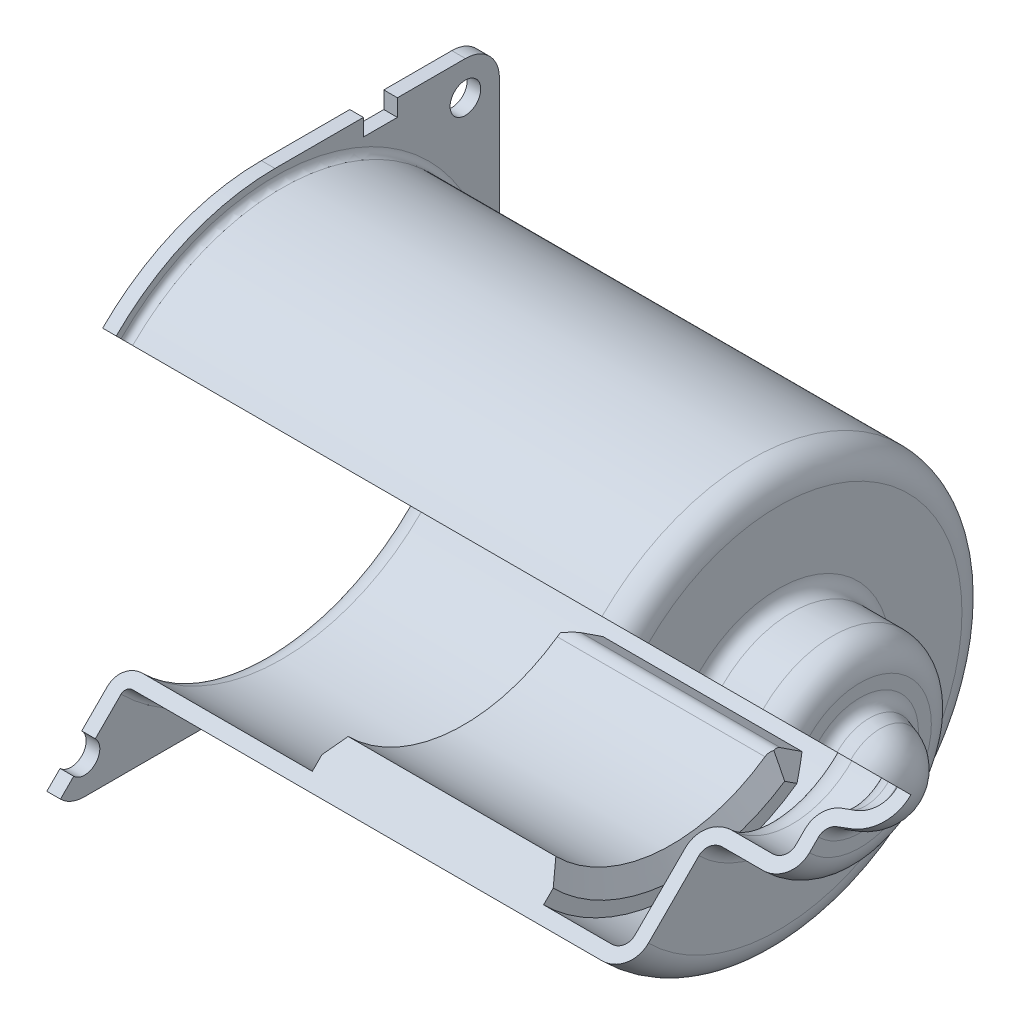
ISO-10303-21;
HEADER;
FILE_DESCRIPTION(('STEP AP214'),'2;1');
FILE_NAME('part.step','',(''),(''),'','','');
FILE_SCHEMA(('AUTOMOTIVE_DESIGN { 1 0 10303 214 1 1 1 1 }'));
ENDSEC;
DATA;
#1=APPLICATION_CONTEXT('core data for automotive mechanical design processes');
#2=APPLICATION_PROTOCOL_DEFINITION('international standard','automotive_design',2000,#1);
#3=PRODUCT_CONTEXT('',#1,'mechanical');
#4=PRODUCT('Part','Part','',(#3));
#5=PRODUCT_RELATED_PRODUCT_CATEGORY('part','',(#4));
#6=PRODUCT_DEFINITION_FORMATION('','',#4);
#7=PRODUCT_DEFINITION_CONTEXT('part definition',#1,'design');
#8=PRODUCT_DEFINITION('design','',#6,#7);
#9=PRODUCT_DEFINITION_SHAPE('','',#8);
#10=(LENGTH_UNIT() NAMED_UNIT(*) SI_UNIT(.MILLI.,.METRE.));
#11=(NAMED_UNIT(*) PLANE_ANGLE_UNIT() SI_UNIT($,.RADIAN.));
#12=(NAMED_UNIT(*) SI_UNIT($,.STERADIAN.) SOLID_ANGLE_UNIT());
#13=UNCERTAINTY_MEASURE_WITH_UNIT(LENGTH_MEASURE(1.E-05),#10,'distance_accuracy_value','');
#14=(GEOMETRIC_REPRESENTATION_CONTEXT(3) GLOBAL_UNCERTAINTY_ASSIGNED_CONTEXT((#13)) GLOBAL_UNIT_ASSIGNED_CONTEXT((#10,
#11,#12)) REPRESENTATION_CONTEXT('',''));
#15=CARTESIAN_POINT('',(0.,0.,0.));
#16=DIRECTION('',(0.,0.,1.));
#17=DIRECTION('',(1.,0.,0.));
#18=AXIS2_PLACEMENT_3D('',#15,#16,#17);
#19=CARTESIAN_POINT('',(93.4997949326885,0.,0.));
#20=DIRECTION('',(-1.,0.,0.));
#21=DIRECTION('',(0.,0.,1.));
#22=AXIS2_PLACEMENT_3D('',#19,#20,#21);
#23=CYLINDRICAL_SURFACE('',#22,29.);
#24=CARTESIAN_POINT('',(62.,0.,0.));
#25=DIRECTION('',(-1.,0.,0.));
#26=DIRECTION('',(0.,0.,1.));
#27=AXIS2_PLACEMENT_3D('',#24,#25,#26);
#28=CIRCLE('',#27,29.);
#29=CARTESIAN_POINT('',(62.,-7.17928601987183,-28.0972926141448));
#30=VERTEX_POINT('',#29);
#31=CARTESIAN_POINT('',(62.,22.8718110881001,17.8291967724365));
#32=VERTEX_POINT('',#31);
#33=EDGE_CURVE('E608',#30,#32,#28,.F.);
#34=ORIENTED_EDGE('',*,*,#33,.F.);
#35=CARTESIAN_POINT('',(45.759099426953,0.,0.));
#36=DIRECTION('',(-0.500000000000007,0.724676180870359,-0.474177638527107));
#37=DIRECTION('',(-0.866025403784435,-0.418391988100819,0.273766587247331));
#38=AXIS2_PLACEMENT_3D('',#35,#36,#37);
#39=ELLIPSE('',#38,57.9999999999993,29.);
#40=CARTESIAN_POINT('',(59.,-8.9199280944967,-27.5941095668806));
#41=VERTEX_POINT('',#40);
#42=EDGE_CURVE('E761',#30,#41,#39,.T.);
#43=ORIENTED_EDGE('',*,*,#42,.T.);
#44=DIRECTION('',(-1.,0.,0.));
#45=VECTOR('',#44,1.);
#46=CARTESIAN_POINT('',(93.4997949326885,-8.9199280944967,-27.5941095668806));
#47=LINE('',#46,#45);
#48=CARTESIAN_POINT('',(29.7320508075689,-8.9199280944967,-27.5941095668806));
#49=VERTEX_POINT('',#48);
#50=EDGE_CURVE('E605',#49,#41,#47,.F.);
#51=ORIENTED_EDGE('',*,*,#50,.F.);
#52=CARTESIAN_POINT('',(34.1456843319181,0.,0.));
#53=DIRECTION('',(-0.866025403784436,-0.418391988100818,0.27376658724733));
#54=DIRECTION('',(-0.500000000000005,0.72467618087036,-0.474177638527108));
#55=AXIS2_PLACEMENT_3D('',#52,#53,#54);
#56=ELLIPSE('',#55,33.4863156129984,29.);
#57=CARTESIAN_POINT('',(28.,-5.86286206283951,-28.4011768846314));
#58=VERTEX_POINT('',#57);
#59=EDGE_CURVE('E767',#49,#58,#56,.F.);
#60=ORIENTED_EDGE('',*,*,#59,.T.);
#61=CARTESIAN_POINT('',(28.,0.,0.));
#62=DIRECTION('',(-1.,0.,0.));
#63=DIRECTION('',(0.,0.,1.));
#64=AXIS2_PLACEMENT_3D('',#61,#62,#63);
#65=CIRCLE('',#64,29.);
#66=CARTESIAN_POINT('',(28.,22.8718110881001,17.8291967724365));
#67=VERTEX_POINT('',#66);
#68=EDGE_CURVE('E599',#58,#67,#65,.F.);
#69=ORIENTED_EDGE('',*,*,#68,.T.);
#70=CARTESIAN_POINT('',(44.2409005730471,0.,0.));
#71=DIRECTION('',(-0.500000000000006,-0.724676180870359,0.474177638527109));
#72=DIRECTION('',(-0.866025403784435,0.418391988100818,-0.273766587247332));
#73=AXIS2_PLACEMENT_3D('',#70,#71,#72);
#74=ELLIPSE('',#73,57.9999999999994,29.);
#75=CARTESIAN_POINT('',(31.,21.7137484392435,19.2227242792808));
#76=VERTEX_POINT('',#75);
#77=EDGE_CURVE('E765',#67,#76,#74,.F.);
#78=ORIENTED_EDGE('',*,*,#77,.T.);
#79=DIRECTION('',(-1.,0.,0.));
#80=VECTOR('',#79,1.);
#81=CARTESIAN_POINT('',(93.4997949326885,21.7137484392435,19.2227242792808));
#82=LINE('',#81,#80);
#83=CARTESIAN_POINT('',(59.,21.7137484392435,19.2227242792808));
#84=VERTEX_POINT('',#83);
#85=EDGE_CURVE('E602',#84,#76,#82,.T.);
#86=ORIENTED_EDGE('',*,*,#85,.F.);
#87=CARTESIAN_POINT('',(45.759099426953,0.,0.));
#88=DIRECTION('',(-0.500000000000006,0.724676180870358,-0.474177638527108));
#89=DIRECTION('',(-0.866025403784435,-0.418391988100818,0.273766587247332));
#90=AXIS2_PLACEMENT_3D('',#87,#88,#89);
#91=ELLIPSE('',#90,57.9999999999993,29.);
#92=EDGE_CURVE('E773',#84,#32,#91,.T.);
#93=ORIENTED_EDGE('',*,*,#92,.T.);
#94=EDGE_LOOP('',(#34,#43,#51,#60,#69,#78,#86,#93));
#95=FACE_BOUND('',#94,.T.);
#96=DIRECTION('',(-1.,0.,0.));
#97=VECTOR('',#96,1.);
#98=CARTESIAN_POINT('',(93.4997949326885,20.5060966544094,20.5060966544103));
#99=LINE('',#98,#97);
#100=CARTESIAN_POINT('',(3.,20.5060966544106,20.5060966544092));
#101=VERTEX_POINT('',#100);
#102=CARTESIAN_POINT('',(72.0000000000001,20.5060966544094,20.5060966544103));
#103=VERTEX_POINT('',#102);
#104=EDGE_CURVE('E862',#101,#103,#99,.F.);
#105=ORIENTED_EDGE('',*,*,#104,.F.);
#106=CARTESIAN_POINT('',(3.,0.,0.));
#107=DIRECTION('',(-1.,0.,0.));
#108=DIRECTION('',(0.,0.,1.));
#109=AXIS2_PLACEMENT_3D('',#106,#107,#108);
#110=CIRCLE('',#109,29.);
#111=CARTESIAN_POINT('',(3.,-20.5060966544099,20.5060966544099));
#112=VERTEX_POINT('',#111);
#113=EDGE_CURVE('E584',#101,#112,#110,.T.);
#114=ORIENTED_EDGE('',*,*,#113,.T.);
#115=DIRECTION('',(-1.,0.,0.));
#116=VECTOR('',#115,1.);
#117=CARTESIAN_POINT('',(93.4997949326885,-20.5060966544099,20.5060966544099));
#118=LINE('',#117,#116);
#119=CARTESIAN_POINT('',(28.,-20.5060966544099,20.5060966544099));
#120=VERTEX_POINT('',#119);
#121=EDGE_CURVE('E802',#112,#120,#118,.F.);
#122=ORIENTED_EDGE('',*,*,#121,.T.);
#123=CARTESIAN_POINT('',(28.,0.,0.));
#124=DIRECTION('',(1.,0.,0.));
#125=DIRECTION('',(0.,0.,-1.));
#126=AXIS2_PLACEMENT_3D('',#123,#124,#125);
#127=CIRCLE('',#126,29.);
#128=CARTESIAN_POINT('',(28.,-22.8718110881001,-17.8291967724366));
#129=VERTEX_POINT('',#128);
#130=EDGE_CURVE('E590',#129,#120,#127,.F.);
#131=ORIENTED_EDGE('',*,*,#130,.F.);
#132=CARTESIAN_POINT('',(44.2409005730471,0.,0.));
#133=DIRECTION('',(-0.500000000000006,0.724676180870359,-0.474177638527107));
#134=DIRECTION('',(-0.866025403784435,-0.418391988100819,0.273766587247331));
#135=AXIS2_PLACEMENT_3D('',#132,#133,#134);
#136=ELLIPSE('',#135,57.9999999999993,29.);
#137=CARTESIAN_POINT('',(31.,-21.7137484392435,-19.2227242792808));
#138=VERTEX_POINT('',#137);
#139=EDGE_CURVE('E769',#129,#138,#136,.F.);
#140=ORIENTED_EDGE('',*,*,#139,.T.);
#141=DIRECTION('',(-1.,0.,0.));
#142=VECTOR('',#141,1.);
#143=CARTESIAN_POINT('',(93.4997949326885,-21.7137484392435,-19.2227242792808));
#144=LINE('',#143,#142);
#145=CARTESIAN_POINT('',(60.2679491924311,-21.7137484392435,-19.2227242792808));
#146=VERTEX_POINT('',#145);
#147=EDGE_CURVE('E593',#138,#146,#144,.F.);
#148=ORIENTED_EDGE('',*,*,#147,.T.);
#149=CARTESIAN_POINT('',(55.8543156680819,0.,0.));
#150=DIRECTION('',(-0.866025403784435,-0.418391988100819,0.273766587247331));
#151=DIRECTION('',(-0.500000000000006,0.724676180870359,-0.474177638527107));
#152=AXIS2_PLACEMENT_3D('',#149,#150,#151);
#153=ELLIPSE('',#152,33.4863156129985,29.);
#154=CARTESIAN_POINT('',(62.,-23.6773862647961,-16.7445925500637));
#155=VERTEX_POINT('',#154);
#156=EDGE_CURVE('E771',#146,#155,#153,.T.);
#157=ORIENTED_EDGE('',*,*,#156,.T.);
#158=CARTESIAN_POINT('',(62.,0.,0.));
#159=DIRECTION('',(1.,0.,0.));
#160=DIRECTION('',(0.,0.,-1.));
#161=AXIS2_PLACEMENT_3D('',#158,#159,#160);
#162=CIRCLE('',#161,29.);
#163=CARTESIAN_POINT('',(62.,-20.5060966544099,20.5060966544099));
#164=VERTEX_POINT('',#163);
#165=EDGE_CURVE('E596',#155,#164,#162,.F.);
#166=ORIENTED_EDGE('',*,*,#165,.T.);
#167=CARTESIAN_POINT('',(72.0000000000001,-20.5060966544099,20.5060966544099));
#168=VERTEX_POINT('',#167);
#169=EDGE_CURVE('E796',#164,#168,#118,.F.);
#170=ORIENTED_EDGE('',*,*,#169,.T.);
#171=CARTESIAN_POINT('',(72.0000000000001,0.,0.));
#172=DIRECTION('',(-1.,0.,0.));
#173=DIRECTION('',(0.,0.,1.));
#174=AXIS2_PLACEMENT_3D('',#171,#172,#173);
#175=CIRCLE('',#174,29.);
#176=EDGE_CURVE('E526',#103,#168,#175,.T.);
#177=ORIENTED_EDGE('',*,*,#176,.F.);
#178=EDGE_LOOP('',(#105,#114,#122,#131,#140,#148,#157,#166,#170,#177));
#179=FACE_BOUND('',#178,.T.);
#180=ADVANCED_FACE('F34',(#95,#179),#23,.F.);
#181=CARTESIAN_POINT('',(0.,29.,0.));
#182=DIRECTION('',(-1.,0.,0.));
#183=DIRECTION('',(0.,0.,1.));
#184=AXIS2_PLACEMENT_3D('',#181,#182,#183);
#185=PLANE('',#184);
#186=CARTESIAN_POINT('',(0.,28.,-28.));
#187=DIRECTION('',(-1.,0.,0.));
#188=DIRECTION('',(0.,0.,1.));
#189=AXIS2_PLACEMENT_3D('',#186,#187,#188);
#190=CIRCLE('',#189,2.25);
#191=CARTESIAN_POINT('',(0.,28.,-25.75));
#192=VERTEX_POINT('',#191);
#193=EDGE_CURVE('E438',#192,#192,#190,.T.);
#194=ORIENTED_EDGE('',*,*,#193,.F.);
#195=EDGE_LOOP('',(#194));
#196=FACE_BOUND('',#195,.T.);
#197=CARTESIAN_POINT('',(0.,0.,0.));
#198=DIRECTION('',(-1.,0.,0.));
#199=DIRECTION('',(0.,0.,1.));
#200=AXIS2_PLACEMENT_3D('',#197,#198,#199);
#201=CIRCLE('',#200,32.);
#202=CARTESIAN_POINT('',(0.,-22.6274169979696,22.6274169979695));
#203=VERTEX_POINT('',#202);
#204=CARTESIAN_POINT('',(0.,22.6274169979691,22.6274169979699));
#205=VERTEX_POINT('',#204);
#206=EDGE_CURVE('E587',#203,#205,#201,.F.);
#207=ORIENTED_EDGE('',*,*,#206,.T.);
#208=DIRECTION('',(0.,0.707106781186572,0.707106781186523));
#209=VECTOR('',#208,1.);
#210=CARTESIAN_POINT('',(0.,-1.26703973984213E-12,1.04394009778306E-12));
#211=LINE('',#210,#209);
#212=CARTESIAN_POINT('',(0.,23.3345237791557,23.3345237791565));
#213=VERTEX_POINT('',#212);
#214=EDGE_CURVE('E947',#205,#213,#211,.T.);
#215=ORIENTED_EDGE('',*,*,#214,.T.);
#216=CARTESIAN_POINT('',(0.,0.,0.));
#217=DIRECTION('',(-1.,0.,0.));
#218=DIRECTION('',(0.,0.,1.));
#219=AXIS2_PLACEMENT_3D('',#216,#217,#218);
#220=CIRCLE('',#219,33.);
#221=CARTESIAN_POINT('',(0.,33.,0.));
#222=VERTEX_POINT('',#221);
#223=EDGE_CURVE('E444',#213,#222,#220,.T.);
#224=ORIENTED_EDGE('',*,*,#223,.T.);
#225=DIRECTION('',(0.,0.,-1.));
#226=VECTOR('',#225,1.);
#227=CARTESIAN_POINT('',(0.,33.,0.));
#228=LINE('',#227,#226);
#229=CARTESIAN_POINT('',(0.,33.,-13.));
#230=VERTEX_POINT('',#229);
#231=EDGE_CURVE('E445',#222,#230,#228,.T.);
#232=ORIENTED_EDGE('',*,*,#231,.T.);
#233=DIRECTION('',(0.,1.,0.));
#234=VECTOR('',#233,1.);
#235=CARTESIAN_POINT('',(0.,30.5,-13.));
#236=LINE('',#235,#234);
#237=CARTESIAN_POINT('',(0.,30.5,-13.));
#238=VERTEX_POINT('',#237);
#239=EDGE_CURVE('E448',#238,#230,#236,.T.);
#240=ORIENTED_EDGE('',*,*,#239,.F.);
#241=DIRECTION('',(0.,0.,-1.));
#242=VECTOR('',#241,1.);
#243=CARTESIAN_POINT('',(0.,30.5,-13.));
#244=LINE('',#243,#242);
#245=CARTESIAN_POINT('',(0.,30.5,-18.));
#246=VERTEX_POINT('',#245);
#247=EDGE_CURVE('E451',#238,#246,#244,.T.);
#248=ORIENTED_EDGE('',*,*,#247,.T.);
#249=DIRECTION('',(0.,-1.,0.));
#250=VECTOR('',#249,1.);
#251=CARTESIAN_POINT('',(0.,33.,-18.));
#252=LINE('',#251,#250);
#253=CARTESIAN_POINT('',(0.,33.,-18.));
#254=VERTEX_POINT('',#253);
#255=EDGE_CURVE('E454',#254,#246,#252,.T.);
#256=ORIENTED_EDGE('',*,*,#255,.F.);
#257=DIRECTION('',(0.,0.,-1.));
#258=VECTOR('',#257,1.);
#259=CARTESIAN_POINT('',(0.,33.,-18.));
#260=LINE('',#259,#258);
#261=CARTESIAN_POINT('',(0.,33.,-28.));
#262=VERTEX_POINT('',#261);
#263=EDGE_CURVE('E457',#254,#262,#260,.T.);
#264=ORIENTED_EDGE('',*,*,#263,.T.);
#265=CARTESIAN_POINT('',(0.,28.,-28.));
#266=DIRECTION('',(-1.,0.,0.));
#267=DIRECTION('',(0.,0.,1.));
#268=AXIS2_PLACEMENT_3D('',#265,#266,#267);
#269=CIRCLE('',#268,5.);
#270=CARTESIAN_POINT('',(0.,28.,-33.));
#271=VERTEX_POINT('',#270);
#272=EDGE_CURVE('E460',#262,#271,#269,.T.);
#273=ORIENTED_EDGE('',*,*,#272,.T.);
#274=DIRECTION('',(0.,-1.,0.));
#275=VECTOR('',#274,1.);
#276=CARTESIAN_POINT('',(0.,28.,-33.));
#277=LINE('',#276,#275);
#278=CARTESIAN_POINT('',(0.,0.,-33.));
#279=VERTEX_POINT('',#278);
#280=EDGE_CURVE('E463',#271,#279,#277,.T.);
#281=ORIENTED_EDGE('',*,*,#280,.T.);
#282=CARTESIAN_POINT('',(0.,-33.,0.));
#283=VERTEX_POINT('',#282);
#284=EDGE_CURVE('E466',#279,#283,#220,.T.);
#285=ORIENTED_EDGE('',*,*,#284,.T.);
#286=DIRECTION('',(0.,0.,-1.));
#287=VECTOR('',#286,1.);
#288=CARTESIAN_POINT('',(0.,-33.,28.));
#289=LINE('',#288,#287);
#290=CARTESIAN_POINT('',(0.,-33.,28.));
#291=VERTEX_POINT('',#290);
#292=EDGE_CURVE('E469',#291,#283,#289,.T.);
#293=ORIENTED_EDGE('',*,*,#292,.F.);
#294=CARTESIAN_POINT('',(0.,-28.,28.));
#295=DIRECTION('',(1.,0.,0.));
#296=DIRECTION('',(0.,0.,-1.));
#297=AXIS2_PLACEMENT_3D('',#294,#295,#296);
#298=CIRCLE('',#297,5.);
#299=CARTESIAN_POINT('',(0.,-31.5355339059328,31.5355339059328));
#300=VERTEX_POINT('',#299);
#301=EDGE_CURVE('E472',#300,#291,#298,.T.);
#302=ORIENTED_EDGE('',*,*,#301,.F.);
#303=DIRECTION('',(0.,-0.707106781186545,0.70710678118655));
#304=VECTOR('',#303,1.);
#305=CARTESIAN_POINT('',(0.,-1.26703973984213E-12,1.04394009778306E-12));
#306=LINE('',#305,#304);
#307=CARTESIAN_POINT('',(0.,-29.5909902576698,29.5909902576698));
#308=VERTEX_POINT('',#307);
#309=EDGE_CURVE('E945',#308,#300,#306,.T.);
#310=ORIENTED_EDGE('',*,*,#309,.F.);
#311=CARTESIAN_POINT('',(0.,-28.,28.));
#312=DIRECTION('',(1.,0.,0.));
#313=DIRECTION('',(0.,0.,-1.));
#314=AXIS2_PLACEMENT_3D('',#311,#312,#313);
#315=CIRCLE('',#314,2.25);
#316=CARTESIAN_POINT('',(0.,-26.4090097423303,26.4090097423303));
#317=VERTEX_POINT('',#316);
#318=EDGE_CURVE('E432',#308,#317,#315,.T.);
#319=ORIENTED_EDGE('',*,*,#318,.T.);
#320=EDGE_CURVE('E417',#203,#317,#306,.T.);
#321=ORIENTED_EDGE('',*,*,#320,.F.);
#322=EDGE_LOOP('',(#207,#215,#224,#232,#240,#248,#256,#264,#273,#281,#285,#293,#302,#310,#319,#321));
#323=FACE_BOUND('',#322,.T.);
#324=ADVANCED_FACE('F921',(#196,#323),#185,.T.);
#325=CARTESIAN_POINT('',(89.0000000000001,0.,0.));
#326=DIRECTION('',(0.,0.,1.));
#327=DIRECTION('',(1.,0.,0.));
#328=AXIS2_PLACEMENT_3D('',#325,#326,#327);
#329=SPHERICAL_SURFACE('',#328,4.49979493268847);
#330=CARTESIAN_POINT('',(89.0000000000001,-1.11549821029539E-13,-1.11549821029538E-13));
#331=DIRECTION('',(0.,-0.70710678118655,-0.707106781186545));
#332=DIRECTION('',(0.,0.707106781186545,-0.70710678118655));
#333=AXIS2_PLACEMENT_3D('',#330,#331,#332);
#334=CIRCLE('',#333,4.49979493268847);
#335=CARTESIAN_POINT('',(93.4997949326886,-1.26703973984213E-12,1.04394009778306E-12));
#336=VERTEX_POINT('',#335);
#337=CARTESIAN_POINT('',(90.34361519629,-3.03668014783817,3.03668014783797));
#338=VERTEX_POINT('',#337);
#339=EDGE_CURVE('E827',#336,#338,#334,.T.);
#340=ORIENTED_EDGE('',*,*,#339,.F.);
#341=CARTESIAN_POINT('',(89.0000000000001,-1.15548991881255E-12,1.15548991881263E-12));
#342=DIRECTION('',(0.,-0.707106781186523,0.707106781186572));
#343=DIRECTION('',(0.,-0.707106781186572,-0.707106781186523));
#344=AXIS2_PLACEMENT_3D('',#341,#342,#343);
#345=CIRCLE('',#344,4.49979493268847);
#346=CARTESIAN_POINT('',(90.34361519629,3.03668014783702,3.03668014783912));
#347=VERTEX_POINT('',#346);
#348=EDGE_CURVE('E415',#336,#347,#345,.T.);
#349=ORIENTED_EDGE('',*,*,#348,.T.);
#350=CARTESIAN_POINT('',(90.34361519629,0.,0.));
#351=DIRECTION('',(-1.,0.,0.));
#352=DIRECTION('',(0.,0.,1.));
#353=AXIS2_PLACEMENT_3D('',#350,#351,#352);
#354=CIRCLE('',#353,4.29451424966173);
#355=EDGE_CURVE('E550',#347,#338,#354,.T.);
#356=ORIENTED_EDGE('',*,*,#355,.T.);
#357=EDGE_LOOP('',(#340,#349,#356));
#358=FACE_BOUND('',#357,.T.);
#359=ADVANCED_FACE('F926',(#358),#329,.F.);
#360=CARTESIAN_POINT('',(88.8056209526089,0.,0.));
#361=DIRECTION('',(-1.,0.,0.));
#362=DIRECTION('',(0.,0.,1.));
#363=AXIS2_PLACEMENT_3D('',#360,#361,#362);
#364=CONICAL_SURFACE('',#363,4.77570311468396,0.303219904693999);
#365=DIRECTION('',(-0.95437999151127,0.211138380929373,0.211138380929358));
#366=VECTOR('',#365,1.);
#367=CARTESIAN_POINT('',(104.069905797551,-1.15548991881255E-12,1.15548991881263E-12));
#368=LINE('',#367,#366);
#369=CARTESIAN_POINT('',(88.8056209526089,3.37693205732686,3.37693205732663));
#370=VERTEX_POINT('',#369);
#371=EDGE_CURVE('E879',#370,#347,#368,.F.);
#372=ORIENTED_EDGE('',*,*,#371,.F.);
#373=CARTESIAN_POINT('',(88.8056209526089,0.,0.));
#374=DIRECTION('',(-1.,0.,0.));
#375=DIRECTION('',(0.,0.,1.));
#376=AXIS2_PLACEMENT_3D('',#373,#374,#375);
#377=CIRCLE('',#376,4.77570311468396);
#378=CARTESIAN_POINT('',(88.8056209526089,-3.37693205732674,3.37693205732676));
#379=VERTEX_POINT('',#378);
#380=EDGE_CURVE('E547',#370,#379,#377,.T.);
#381=ORIENTED_EDGE('',*,*,#380,.T.);
#382=DIRECTION('',(-0.95437999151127,-0.211138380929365,0.211138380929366));
#383=VECTOR('',#382,1.);
#384=CARTESIAN_POINT('',(104.069905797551,-1.11549821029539E-13,-1.11549821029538E-13));
#385=LINE('',#384,#383);
#386=EDGE_CURVE('E824',#379,#338,#385,.F.);
#387=ORIENTED_EDGE('',*,*,#386,.T.);
#388=ORIENTED_EDGE('',*,*,#355,.F.);
#389=EDGE_LOOP('',(#372,#381,#387,#388));
#390=FACE_BOUND('',#389,.T.);
#391=ADVANCED_FACE('F1115',(#390),#364,.F.);
#392=CARTESIAN_POINT('',(90.0000000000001,0.,0.));
#393=DIRECTION('',(-1.,0.,0.));
#394=DIRECTION('',(0.,0.,1.));
#395=AXIS2_PLACEMENT_3D('',#392,#393,#394);
#396=TOROIDAL_SURFACE('',#395,8.59322308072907,4.);
#397=CARTESIAN_POINT('',(90.0000000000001,6.07632631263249,6.07632631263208));
#398=DIRECTION('',(0.,-0.707106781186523,0.707106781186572));
#399=DIRECTION('',(0.,-0.707106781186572,-0.707106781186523));
#400=AXIS2_PLACEMENT_3D('',#397,#398,#399);
#401=CIRCLE('',#400,4.);
#402=CARTESIAN_POINT('',(86.0000000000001,6.07632631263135,6.07632631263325));
#403=VERTEX_POINT('',#402);
#404=EDGE_CURVE('E877',#403,#370,#401,.T.);
#405=ORIENTED_EDGE('',*,*,#404,.F.);
#406=CARTESIAN_POINT('',(86.0000000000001,0.,0.));
#407=DIRECTION('',(-1.,0.,0.));
#408=DIRECTION('',(0.,0.,1.));
#409=AXIS2_PLACEMENT_3D('',#406,#407,#408);
#410=CIRCLE('',#409,8.5932230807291);
#411=CARTESIAN_POINT('',(86.0000000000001,-6.07632631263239,6.07632631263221));
#412=VERTEX_POINT('',#411);
#413=EDGE_CURVE('E544',#403,#412,#410,.T.);
#414=ORIENTED_EDGE('',*,*,#413,.T.);
#415=CARTESIAN_POINT('',(90.0000000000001,-6.07632631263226,6.0763263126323));
#416=DIRECTION('',(0.,-0.70710678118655,-0.707106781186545));
#417=DIRECTION('',(0.,0.707106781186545,-0.70710678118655));
#418=AXIS2_PLACEMENT_3D('',#415,#416,#417);
#419=CIRCLE('',#418,4.);
#420=EDGE_CURVE('E821',#412,#379,#419,.T.);
#421=ORIENTED_EDGE('',*,*,#420,.T.);
#422=ORIENTED_EDGE('',*,*,#380,.F.);
#423=EDGE_LOOP('',(#405,#414,#421,#422));
#424=FACE_BOUND('',#423,.T.);
#425=ADVANCED_FACE('F1111',(#424),#396,.T.);
#426=CARTESIAN_POINT('',(86.0000000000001,10.5,0.));
#427=DIRECTION('',(1.,0.,0.));
#428=DIRECTION('',(0.,0.,-1.));
#429=AXIS2_PLACEMENT_3D('',#426,#427,#428);
#430=PLANE('',#429);
#431=DIRECTION('',(0.,-0.707106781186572,-0.707106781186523));
#432=VECTOR('',#431,1.);
#433=CARTESIAN_POINT('',(86.0000000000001,5.24999999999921,5.25000000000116));
#434=LINE('',#433,#432);
#435=CARTESIAN_POINT('',(86.0000000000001,7.42462120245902,7.42462120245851));
#436=VERTEX_POINT('',#435);
#437=EDGE_CURVE('E875',#436,#403,#434,.T.);
#438=ORIENTED_EDGE('',*,*,#437,.F.);
#439=CARTESIAN_POINT('',(86.0000000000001,0.,0.));
#440=DIRECTION('',(-1.,0.,0.));
#441=DIRECTION('',(0.,0.,1.));
#442=AXIS2_PLACEMENT_3D('',#439,#440,#441);
#443=CIRCLE('',#442,10.5);
#444=CARTESIAN_POINT('',(86.0000000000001,-7.42462120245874,7.42462120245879));
#445=VERTEX_POINT('',#444);
#446=EDGE_CURVE('E541',#436,#445,#443,.T.);
#447=ORIENTED_EDGE('',*,*,#446,.T.);
#448=DIRECTION('',(0.,0.707106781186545,-0.70710678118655));
#449=VECTOR('',#448,1.);
#450=CARTESIAN_POINT('',(86.0000000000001,5.24999999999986,-5.25000000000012));
#451=LINE('',#450,#449);
#452=EDGE_CURVE('E818',#445,#412,#451,.T.);
#453=ORIENTED_EDGE('',*,*,#452,.T.);
#454=ORIENTED_EDGE('',*,*,#413,.F.);
#455=EDGE_LOOP('',(#438,#447,#453,#454));
#456=FACE_BOUND('',#455,.T.);
#457=ADVANCED_FACE('F1107',(#456),#430,.F.);
#458=CARTESIAN_POINT('',(84.0000000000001,0.,0.));
#459=DIRECTION('',(-1.,0.,0.));
#460=DIRECTION('',(0.,0.,1.));
#461=AXIS2_PLACEMENT_3D('',#458,#459,#460);
#462=TOROIDAL_SURFACE('',#461,10.5,1.99999999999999);
#463=ORIENTED_EDGE('',*,*,#446,.F.);
#464=CARTESIAN_POINT('',(84.0000000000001,7.42462120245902,7.42462120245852));
#465=DIRECTION('',(0.,-0.707106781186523,0.707106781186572));
#466=DIRECTION('',(0.,-0.707106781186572,-0.707106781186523));
#467=AXIS2_PLACEMENT_3D('',#464,#465,#466);
#468=CIRCLE('',#467,1.99999999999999);
#469=CARTESIAN_POINT('',(84.0000000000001,8.83883476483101,8.83883476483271));
#470=VERTEX_POINT('',#469);
#471=EDGE_CURVE('E872',#436,#470,#468,.T.);
#472=ORIENTED_EDGE('',*,*,#471,.T.);
#473=CARTESIAN_POINT('',(84.0000000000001,0.,0.));
#474=DIRECTION('',(-1.,0.,0.));
#475=DIRECTION('',(0.,0.,1.));
#476=AXIS2_PLACEMENT_3D('',#473,#474,#475);
#477=CIRCLE('',#476,12.5);
#478=CARTESIAN_POINT('',(84.0000000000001,-8.83883476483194,8.83883476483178));
#479=VERTEX_POINT('',#478);
#480=EDGE_CURVE('E538',#470,#479,#477,.T.);
#481=ORIENTED_EDGE('',*,*,#480,.T.);
#482=CARTESIAN_POINT('',(84.0000000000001,-7.42462120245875,7.4246212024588));
#483=DIRECTION('',(0.,-0.70710678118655,-0.707106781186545));
#484=DIRECTION('',(0.,0.707106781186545,-0.70710678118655));
#485=AXIS2_PLACEMENT_3D('',#482,#483,#484);
#486=CIRCLE('',#485,1.99999999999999);
#487=EDGE_CURVE('E816',#445,#479,#486,.T.);
#488=ORIENTED_EDGE('',*,*,#487,.F.);
#489=EDGE_LOOP('',(#463,#472,#481,#488));
#490=FACE_BOUND('',#489,.T.);
#491=ADVANCED_FACE('F1103',(#490),#462,.F.);
#492=CARTESIAN_POINT('',(93.4997949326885,0.,0.));
#493=DIRECTION('',(-1.,0.,0.));
#494=DIRECTION('',(0.,0.,1.));
#495=AXIS2_PLACEMENT_3D('',#492,#493,#494);
#496=CYLINDRICAL_SURFACE('',#495,12.5);
#497=DIRECTION('',(-1.,0.,0.));
#498=VECTOR('',#497,1.);
#499=CARTESIAN_POINT('',(93.4997949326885,8.83883476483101,8.83883476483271));
#500=LINE('',#499,#498);
#501=CARTESIAN_POINT('',(78.0000000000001,8.83883476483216,8.83883476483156));
#502=VERTEX_POINT('',#501);
#503=EDGE_CURVE('E870',#502,#470,#500,.F.);
#504=ORIENTED_EDGE('',*,*,#503,.F.);
#505=CARTESIAN_POINT('',(78.0000000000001,0.,0.));
#506=DIRECTION('',(-1.,0.,0.));
#507=DIRECTION('',(0.,0.,1.));
#508=AXIS2_PLACEMENT_3D('',#505,#506,#507);
#509=CIRCLE('',#508,12.5);
#510=CARTESIAN_POINT('',(78.0000000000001,-8.83883476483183,8.83883476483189));
#511=VERTEX_POINT('',#510);
#512=EDGE_CURVE('E535',#502,#511,#509,.T.);
#513=ORIENTED_EDGE('',*,*,#512,.T.);
#514=DIRECTION('',(-1.,0.,0.));
#515=VECTOR('',#514,1.);
#516=CARTESIAN_POINT('',(93.4997949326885,-8.83883476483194,8.83883476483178));
#517=LINE('',#516,#515);
#518=EDGE_CURVE('E813',#511,#479,#517,.F.);
#519=ORIENTED_EDGE('',*,*,#518,.T.);
#520=ORIENTED_EDGE('',*,*,#480,.F.);
#521=EDGE_LOOP('',(#504,#513,#519,#520));
#522=FACE_BOUND('',#521,.T.);
#523=ADVANCED_FACE('F1099',(#522),#496,.F.);
#524=CARTESIAN_POINT('',(78.0000000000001,0.,0.));
#525=DIRECTION('',(-1.,0.,0.));
#526=DIRECTION('',(0.,0.,1.));
#527=AXIS2_PLACEMENT_3D('',#524,#525,#526);
#528=TOROIDAL_SURFACE('',#527,16.5,4.);
#529=CARTESIAN_POINT('',(78.0000000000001,11.6672618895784,11.6672618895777));
#530=DIRECTION('',(0.,-0.707106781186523,0.707106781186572));
#531=DIRECTION('',(0.,-0.707106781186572,-0.707106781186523));
#532=AXIS2_PLACEMENT_3D('',#529,#530,#531);
#533=CIRCLE('',#532,4.);
#534=CARTESIAN_POINT('',(74.0000000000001,11.6672618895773,11.6672618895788));
#535=VERTEX_POINT('',#534);
#536=EDGE_CURVE('E868',#535,#502,#533,.T.);
#537=ORIENTED_EDGE('',*,*,#536,.F.);
#538=CARTESIAN_POINT('',(74.0000000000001,0.,0.));
#539=DIRECTION('',(-1.,0.,0.));
#540=DIRECTION('',(0.,0.,1.));
#541=AXIS2_PLACEMENT_3D('',#538,#539,#540);
#542=CIRCLE('',#541,16.5);
#543=CARTESIAN_POINT('',(74.0000000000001,-11.6672618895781,11.667261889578));
#544=VERTEX_POINT('',#543);
#545=EDGE_CURVE('E532',#535,#544,#542,.T.);
#546=ORIENTED_EDGE('',*,*,#545,.T.);
#547=CARTESIAN_POINT('',(78.0000000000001,-11.667261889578,11.6672618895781));
#548=DIRECTION('',(0.,-0.70710678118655,-0.707106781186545));
#549=DIRECTION('',(0.,0.707106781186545,-0.70710678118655));
#550=AXIS2_PLACEMENT_3D('',#547,#548,#549);
#551=CIRCLE('',#550,4.);
#552=EDGE_CURVE('E810',#544,#511,#551,.T.);
#553=ORIENTED_EDGE('',*,*,#552,.T.);
#554=ORIENTED_EDGE('',*,*,#512,.F.);
#555=EDGE_LOOP('',(#537,#546,#553,#554));
#556=FACE_BOUND('',#555,.T.);
#557=ADVANCED_FACE('F1095',(#556),#528,.T.);
#558=CARTESIAN_POINT('',(74.0000000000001,27.,0.));
#559=DIRECTION('',(1.,0.,0.));
#560=DIRECTION('',(0.,0.,-1.));
#561=AXIS2_PLACEMENT_3D('',#558,#559,#560);
#562=PLANE('',#561);
#563=DIRECTION('',(0.,-0.707106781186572,-0.707106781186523));
#564=VECTOR('',#563,1.);
#565=CARTESIAN_POINT('',(74.0000000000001,13.4999999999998,13.5000000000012));
#566=LINE('',#565,#564);
#567=CARTESIAN_POINT('',(74.0000000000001,19.0918830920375,19.0918830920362));
#568=VERTEX_POINT('',#567);
#569=EDGE_CURVE('E866',#568,#535,#566,.T.);
#570=ORIENTED_EDGE('',*,*,#569,.F.);
#571=CARTESIAN_POINT('',(74.0000000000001,0.,0.));
#572=DIRECTION('',(-1.,0.,0.));
#573=DIRECTION('',(0.,0.,1.));
#574=AXIS2_PLACEMENT_3D('',#571,#572,#573);
#575=CIRCLE('',#574,27.);
#576=CARTESIAN_POINT('',(74.0000000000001,-19.0918830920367,19.0918830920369));
#577=VERTEX_POINT('',#576);
#578=EDGE_CURVE('E529',#568,#577,#575,.T.);
#579=ORIENTED_EDGE('',*,*,#578,.T.);
#580=DIRECTION('',(0.,0.707106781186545,-0.70710678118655));
#581=VECTOR('',#580,1.);
#582=CARTESIAN_POINT('',(74.0000000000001,13.4999999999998,-13.5000000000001));
#583=LINE('',#582,#581);
#584=EDGE_CURVE('E807',#577,#544,#583,.T.);
#585=ORIENTED_EDGE('',*,*,#584,.T.);
#586=ORIENTED_EDGE('',*,*,#545,.F.);
#587=EDGE_LOOP('',(#570,#579,#585,#586));
#588=FACE_BOUND('',#587,.T.);
#589=ADVANCED_FACE('F1091',(#588),#562,.F.);
#590=CARTESIAN_POINT('',(72.0000000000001,0.,0.));
#591=DIRECTION('',(-1.,0.,0.));
#592=DIRECTION('',(0.,0.,1.));
#593=AXIS2_PLACEMENT_3D('',#590,#591,#592);
#594=TOROIDAL_SURFACE('',#593,27.,2.);
#595=CARTESIAN_POINT('',(72.0000000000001,19.0918830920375,19.0918830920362));
#596=DIRECTION('',(0.,-0.707106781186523,0.707106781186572));
#597=DIRECTION('',(0.,-0.707106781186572,-0.707106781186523));
#598=AXIS2_PLACEMENT_3D('',#595,#596,#597);
#599=CIRCLE('',#598,2.);
#600=EDGE_CURVE('E864',#103,#568,#599,.F.);
#601=ORIENTED_EDGE('',*,*,#600,.F.);
#602=ORIENTED_EDGE('',*,*,#176,.T.);
#603=CARTESIAN_POINT('',(72.0000000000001,-19.0918830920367,19.0918830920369));
#604=DIRECTION('',(0.,-0.70710678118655,-0.707106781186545));
#605=DIRECTION('',(0.,0.707106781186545,-0.70710678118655));
#606=AXIS2_PLACEMENT_3D('',#603,#604,#605);
#607=CIRCLE('',#606,2.);
#608=EDGE_CURVE('E798',#168,#577,#607,.F.);
#609=ORIENTED_EDGE('',*,*,#608,.T.);
#610=ORIENTED_EDGE('',*,*,#578,.F.);
#611=EDGE_LOOP('',(#601,#602,#609,#610));
#612=FACE_BOUND('',#611,.T.);
#613=ADVANCED_FACE('F1067',(#612),#594,.F.);
#614=CARTESIAN_POINT('',(2.,0.,0.));
#615=DIRECTION('',(-1.,0.,0.));
#616=DIRECTION('',(0.,0.,1.));
#617=AXIS2_PLACEMENT_3D('',#614,#615,#616);
#618=PLANE('',#617);
#619=CARTESIAN_POINT('',(2.,28.,-28.));
#620=DIRECTION('',(-1.,0.,0.));
#621=DIRECTION('',(0.,0.,1.));
#622=AXIS2_PLACEMENT_3D('',#619,#620,#621);
#623=CIRCLE('',#622,2.25);
#624=CARTESIAN_POINT('',(2.,28.,-25.75));
#625=VERTEX_POINT('',#624);
#626=EDGE_CURVE('E441',#625,#625,#623,.T.);
#627=ORIENTED_EDGE('',*,*,#626,.T.);
#628=EDGE_LOOP('',(#627));
#629=FACE_BOUND('',#628,.T.);
#630=DIRECTION('',(0.,0.707106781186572,0.707106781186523));
#631=VECTOR('',#630,1.);
#632=CARTESIAN_POINT('',(2.,-1.15548991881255E-12,1.15548991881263E-12));
#633=LINE('',#632,#631);
#634=CARTESIAN_POINT('',(2.,22.6274169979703,22.6274169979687));
#635=VERTEX_POINT('',#634);
#636=CARTESIAN_POINT('',(2.,23.3345237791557,23.3345237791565));
#637=VERTEX_POINT('',#636);
#638=EDGE_CURVE('E421',#635,#637,#633,.T.);
#639=ORIENTED_EDGE('',*,*,#638,.F.);
#640=CARTESIAN_POINT('',(2.,0.,0.));
#641=DIRECTION('',(-1.,0.,0.));
#642=DIRECTION('',(0.,0.,1.));
#643=AXIS2_PLACEMENT_3D('',#640,#641,#642);
#644=CIRCLE('',#643,32.);
#645=CARTESIAN_POINT('',(2.,-22.6274169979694,22.6274169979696));
#646=VERTEX_POINT('',#645);
#647=EDGE_CURVE('E581',#635,#646,#644,.T.);
#648=ORIENTED_EDGE('',*,*,#647,.T.);
#649=DIRECTION('',(0.,-0.707106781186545,0.70710678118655));
#650=VECTOR('',#649,1.);
#651=CARTESIAN_POINT('',(2.,-1.11549821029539E-13,-1.11549821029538E-13));
#652=LINE('',#651,#650);
#653=CARTESIAN_POINT('',(2.,-26.4090097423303,26.4090097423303));
#654=VERTEX_POINT('',#653);
#655=EDGE_CURVE('E408',#646,#654,#652,.T.);
#656=ORIENTED_EDGE('',*,*,#655,.T.);
#657=CARTESIAN_POINT('',(2.,-28.,28.));
#658=DIRECTION('',(1.,0.,0.));
#659=DIRECTION('',(0.,0.,-1.));
#660=AXIS2_PLACEMENT_3D('',#657,#658,#659);
#661=CIRCLE('',#660,2.25);
#662=CARTESIAN_POINT('',(2.,-29.5909902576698,29.5909902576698));
#663=VERTEX_POINT('',#662);
#664=EDGE_CURVE('E435',#663,#654,#661,.T.);
#665=ORIENTED_EDGE('',*,*,#664,.F.);
#666=CARTESIAN_POINT('',(2.,-31.5355339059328,31.5355339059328));
#667=VERTEX_POINT('',#666);
#668=EDGE_CURVE('E48',#663,#667,#652,.T.);
#669=ORIENTED_EDGE('',*,*,#668,.T.);
#670=CARTESIAN_POINT('',(2.,-28.,28.));
#671=DIRECTION('',(1.,0.,0.));
#672=DIRECTION('',(0.,0.,-1.));
#673=AXIS2_PLACEMENT_3D('',#670,#671,#672);
#674=CIRCLE('',#673,5.);
#675=CARTESIAN_POINT('',(2.,-33.,28.));
#676=VERTEX_POINT('',#675);
#677=EDGE_CURVE('E502',#667,#676,#674,.T.);
#678=ORIENTED_EDGE('',*,*,#677,.T.);
#679=DIRECTION('',(0.,0.,-1.));
#680=VECTOR('',#679,1.);
#681=CARTESIAN_POINT('',(2.,-33.,28.));
#682=LINE('',#681,#680);
#683=CARTESIAN_POINT('',(2.,-33.,0.));
#684=VERTEX_POINT('',#683);
#685=EDGE_CURVE('E499',#676,#684,#682,.T.);
#686=ORIENTED_EDGE('',*,*,#685,.T.);
#687=CARTESIAN_POINT('',(2.,0.,0.));
#688=DIRECTION('',(-1.,0.,0.));
#689=DIRECTION('',(0.,0.,1.));
#690=AXIS2_PLACEMENT_3D('',#687,#688,#689);
#691=CIRCLE('',#690,33.);
#692=CARTESIAN_POINT('',(2.,0.,-33.));
#693=VERTEX_POINT('',#692);
#694=EDGE_CURVE('E496',#693,#684,#691,.T.);
#695=ORIENTED_EDGE('',*,*,#694,.F.);
#696=DIRECTION('',(0.,-1.,0.));
#697=VECTOR('',#696,1.);
#698=CARTESIAN_POINT('',(2.,28.,-33.));
#699=LINE('',#698,#697);
#700=CARTESIAN_POINT('',(2.,28.,-33.));
#701=VERTEX_POINT('',#700);
#702=EDGE_CURVE('E493',#701,#693,#699,.T.);
#703=ORIENTED_EDGE('',*,*,#702,.F.);
#704=CARTESIAN_POINT('',(2.,28.,-28.));
#705=DIRECTION('',(-1.,0.,0.));
#706=DIRECTION('',(0.,0.,1.));
#707=AXIS2_PLACEMENT_3D('',#704,#705,#706);
#708=CIRCLE('',#707,5.);
#709=CARTESIAN_POINT('',(2.,33.,-28.));
#710=VERTEX_POINT('',#709);
#711=EDGE_CURVE('E490',#710,#701,#708,.T.);
#712=ORIENTED_EDGE('',*,*,#711,.F.);
#713=DIRECTION('',(0.,0.,-1.));
#714=VECTOR('',#713,1.);
#715=CARTESIAN_POINT('',(2.,33.,-18.));
#716=LINE('',#715,#714);
#717=CARTESIAN_POINT('',(2.,33.,-18.));
#718=VERTEX_POINT('',#717);
#719=EDGE_CURVE('E487',#718,#710,#716,.T.);
#720=ORIENTED_EDGE('',*,*,#719,.F.);
#721=DIRECTION('',(0.,-1.,0.));
#722=VECTOR('',#721,1.);
#723=CARTESIAN_POINT('',(2.,33.,-18.));
#724=LINE('',#723,#722);
#725=CARTESIAN_POINT('',(2.,30.5,-18.));
#726=VERTEX_POINT('',#725);
#727=EDGE_CURVE('E484',#718,#726,#724,.T.);
#728=ORIENTED_EDGE('',*,*,#727,.T.);
#729=DIRECTION('',(0.,0.,-1.));
#730=VECTOR('',#729,1.);
#731=CARTESIAN_POINT('',(2.,30.5,-13.));
#732=LINE('',#731,#730);
#733=CARTESIAN_POINT('',(2.,30.5,-13.));
#734=VERTEX_POINT('',#733);
#735=EDGE_CURVE('E481',#734,#726,#732,.T.);
#736=ORIENTED_EDGE('',*,*,#735,.F.);
#737=DIRECTION('',(0.,1.,0.));
#738=VECTOR('',#737,1.);
#739=CARTESIAN_POINT('',(2.,30.5,-13.));
#740=LINE('',#739,#738);
#741=CARTESIAN_POINT('',(2.,33.,-13.));
#742=VERTEX_POINT('',#741);
#743=EDGE_CURVE('E478',#734,#742,#740,.T.);
#744=ORIENTED_EDGE('',*,*,#743,.T.);
#745=DIRECTION('',(0.,0.,-1.));
#746=VECTOR('',#745,1.);
#747=CARTESIAN_POINT('',(2.,33.,0.));
#748=LINE('',#747,#746);
#749=CARTESIAN_POINT('',(2.,33.,0.));
#750=VERTEX_POINT('',#749);
#751=EDGE_CURVE('E475',#750,#742,#748,.T.);
#752=ORIENTED_EDGE('',*,*,#751,.F.);
#753=EDGE_CURVE('E474',#637,#750,#691,.T.);
#754=ORIENTED_EDGE('',*,*,#753,.F.);
#755=EDGE_LOOP('',(#639,#648,#656,#665,#669,#678,#686,#695,#703,#712,#720,#728,#736,#744,#752,#754));
#756=FACE_BOUND('',#755,.T.);
#757=ADVANCED_FACE('F998',(#629,#756),#618,.F.);
#758=CARTESIAN_POINT('',(2.,0.,0.));
#759=DIRECTION('',(-1.,0.,0.));
#760=DIRECTION('',(0.,0.,1.));
#761=AXIS2_PLACEMENT_3D('',#758,#759,#760);
#762=CYLINDRICAL_SURFACE('',#761,33.);
#763=ORIENTED_EDGE('',*,*,#223,.F.);
#764=DIRECTION('',(-1.,0.,0.));
#765=VECTOR('',#764,1.);
#766=CARTESIAN_POINT('',(2.,23.3345237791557,23.3345237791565));
#767=LINE('',#766,#765);
#768=EDGE_CURVE('E424',#213,#637,#767,.F.);
#769=ORIENTED_EDGE('',*,*,#768,.T.);
#770=ORIENTED_EDGE('',*,*,#753,.T.);
#771=DIRECTION('',(-1.,0.,0.));
#772=VECTOR('',#771,1.);
#773=CARTESIAN_POINT('',(2.,33.,0.));
#774=LINE('',#773,#772);
#775=EDGE_CURVE('E504',#750,#222,#774,.T.);
#776=ORIENTED_EDGE('',*,*,#775,.T.);
#777=EDGE_LOOP('',(#763,#769,#770,#776));
#778=FACE_BOUND('',#777,.T.);
#779=ADVANCED_FACE('F918',(#778),#762,.T.);
#780=CARTESIAN_POINT('',(89.0000000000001,0.,0.));
#781=DIRECTION('',(0.,0.,1.));
#782=DIRECTION('',(1.,0.,0.));
#783=AXIS2_PLACEMENT_3D('',#780,#781,#782);
#784=SPHERICAL_SURFACE('',#783,6.5);
#785=CARTESIAN_POINT('',(89.0000000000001,-1.15548991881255E-12,1.15548991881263E-12));
#786=DIRECTION('',(0.,-0.707106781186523,0.707106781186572));
#787=DIRECTION('',(0.,-0.707106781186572,-0.707106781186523));
#788=AXIS2_PLACEMENT_3D('',#785,#786,#787);
#789=CIRCLE('',#788,6.5);
#790=CARTESIAN_POINT('',(95.5000000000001,-1.26703973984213E-12,1.04394009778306E-12));
#791=VERTEX_POINT('',#790);
#792=CARTESIAN_POINT('',(91.0000000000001,4.37321392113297,4.37321392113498));
#793=VERTEX_POINT('',#792);
#794=EDGE_CURVE('E412',#791,#793,#789,.T.);
#795=ORIENTED_EDGE('',*,*,#794,.F.);
#796=CARTESIAN_POINT('',(89.0000000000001,-1.11549821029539E-13,-1.11549821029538E-13));
#797=DIRECTION('',(0.,-0.70710678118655,-0.707106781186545));
#798=DIRECTION('',(0.,0.707106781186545,-0.70710678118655));
#799=AXIS2_PLACEMENT_3D('',#796,#797,#798);
#800=CIRCLE('',#799,6.5);
#801=CARTESIAN_POINT('',(91.0000000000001,-4.37321392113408,4.37321392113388));
#802=VERTEX_POINT('',#801);
#803=EDGE_CURVE('E397',#791,#802,#800,.T.);
#804=ORIENTED_EDGE('',*,*,#803,.T.);
#805=CARTESIAN_POINT('',(91.0000000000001,0.,0.));
#806=DIRECTION('',(-1.,0.,0.));
#807=DIRECTION('',(0.,0.,1.));
#808=AXIS2_PLACEMENT_3D('',#805,#806,#807);
#809=CIRCLE('',#808,6.1846584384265);
#810=EDGE_CURVE('E420',#793,#802,#809,.T.);
#811=ORIENTED_EDGE('',*,*,#810,.F.);
#812=EDGE_LOOP('',(#795,#804,#811));
#813=FACE_BOUND('',#812,.T.);
#814=ADVANCED_FACE('F419',(#813),#784,.T.);
#815=CARTESIAN_POINT('',(91.0000000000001,0.,0.));
#816=DIRECTION('',(-1.,0.,0.));
#817=DIRECTION('',(0.,0.,1.));
#818=AXIS2_PLACEMENT_3D('',#815,#816,#817);
#819=CONICAL_SURFACE('',#818,6.1846584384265,0.312766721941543);
#820=DIRECTION('',(-0.951485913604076,0.217571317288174,0.21757131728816));
#821=VECTOR('',#820,1.);
#822=CARTESIAN_POINT('',(110.125,-1.15548991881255E-12,1.15548991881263E-12));
#823=LINE('',#822,#821);
#824=CARTESIAN_POINT('',(89.3846153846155,4.74259548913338,4.74259548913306));
#825=VERTEX_POINT('',#824);
#826=EDGE_CURVE('E422',#793,#825,#823,.T.);
#827=ORIENTED_EDGE('',*,*,#826,.F.);
#828=ORIENTED_EDGE('',*,*,#810,.T.);
#829=DIRECTION('',(-0.951485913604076,-0.217571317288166,0.217571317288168));
#830=VECTOR('',#829,1.);
#831=CARTESIAN_POINT('',(110.125,-1.11549821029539E-13,-1.11549821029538E-13));
#832=LINE('',#831,#830);
#833=CARTESIAN_POINT('',(89.3846153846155,-4.7425954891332,4.74259548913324));
#834=VERTEX_POINT('',#833);
#835=EDGE_CURVE('E403',#802,#834,#832,.T.);
#836=ORIENTED_EDGE('',*,*,#835,.T.);
#837=CARTESIAN_POINT('',(89.3846153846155,0.,0.));
#838=DIRECTION('',(-1.,0.,0.));
#839=DIRECTION('',(0.,0.,1.));
#840=AXIS2_PLACEMENT_3D('',#837,#838,#839);
#841=CIRCLE('',#840,6.70704286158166);
#842=EDGE_CURVE('E554',#825,#834,#841,.T.);
#843=ORIENTED_EDGE('',*,*,#842,.F.);
#844=EDGE_LOOP('',(#827,#828,#836,#843));
#845=FACE_BOUND('',#844,.T.);
#846=ADVANCED_FACE('F909',(#845),#819,.T.);
#847=CARTESIAN_POINT('',(90.0000000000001,0.,0.));
#848=DIRECTION('',(-1.,0.,0.));
#849=DIRECTION('',(0.,0.,1.));
#850=AXIS2_PLACEMENT_3D('',#847,#848,#849);
#851=TOROIDAL_SURFACE('',#850,8.61001468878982,2.);
#852=CARTESIAN_POINT('',(88.0000000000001,0.,0.));
#853=DIRECTION('',(-1.,0.,0.));
#854=DIRECTION('',(0.,0.,1.));
#855=AXIS2_PLACEMENT_3D('',#852,#853,#854);
#856=CIRCLE('',#855,8.61001468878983);
#857=CARTESIAN_POINT('',(88.0000000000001,6.08819977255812,6.08819977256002));
#858=VERTEX_POINT('',#857);
#859=CARTESIAN_POINT('',(88.0000000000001,-6.08819977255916,6.08819977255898));
#860=VERTEX_POINT('',#859);
#861=EDGE_CURVE('E557',#858,#860,#856,.T.);
#862=ORIENTED_EDGE('',*,*,#861,.F.);
#863=CARTESIAN_POINT('',(90.0000000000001,6.08819977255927,6.08819977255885));
#864=DIRECTION('',(0.,-0.707106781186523,0.707106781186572));
#865=DIRECTION('',(0.,-0.707106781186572,-0.707106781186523));
#866=AXIS2_PLACEMENT_3D('',#863,#864,#865);
#867=CIRCLE('',#866,2.);
#868=EDGE_CURVE('E426',#858,#825,#867,.T.);
#869=ORIENTED_EDGE('',*,*,#868,.T.);
#870=ORIENTED_EDGE('',*,*,#842,.T.);
#871=CARTESIAN_POINT('',(90.0000000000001,-6.08819977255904,6.08819977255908));
#872=DIRECTION('',(0.,-0.70710678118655,-0.707106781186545));
#873=DIRECTION('',(0.,0.707106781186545,-0.70710678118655));
#874=AXIS2_PLACEMENT_3D('',#871,#872,#873);
#875=CIRCLE('',#874,2.);
#876=EDGE_CURVE('E850',#860,#834,#875,.T.);
#877=ORIENTED_EDGE('',*,*,#876,.F.);
#878=EDGE_LOOP('',(#862,#869,#870,#877));
#879=FACE_BOUND('',#878,.T.);
#880=ADVANCED_FACE('F906',(#879),#851,.F.);
#881=CARTESIAN_POINT('',(88.0000000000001,10.5,0.));
#882=DIRECTION('',(1.,0.,0.));
#883=DIRECTION('',(0.,0.,-1.));
#884=AXIS2_PLACEMENT_3D('',#881,#882,#883);
#885=PLANE('',#884);
#886=CARTESIAN_POINT('',(88.0000000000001,0.,0.));
#887=DIRECTION('',(-1.,0.,0.));
#888=DIRECTION('',(0.,0.,1.));
#889=AXIS2_PLACEMENT_3D('',#886,#887,#888);
#890=CIRCLE('',#889,10.5);
#891=CARTESIAN_POINT('',(88.0000000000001,7.424621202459,7.4246212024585));
#892=VERTEX_POINT('',#891);
#893=CARTESIAN_POINT('',(88.0000000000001,-7.42462120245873,7.42462120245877));
#894=VERTEX_POINT('',#893);
#895=EDGE_CURVE('E560',#892,#894,#890,.T.);
#896=ORIENTED_EDGE('',*,*,#895,.F.);
#897=DIRECTION('',(0.,-0.707106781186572,-0.707106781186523));
#898=VECTOR('',#897,1.);
#899=CARTESIAN_POINT('',(88.0000000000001,5.2499999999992,5.25000000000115));
#900=LINE('',#899,#898);
#901=EDGE_CURVE('E900',#892,#858,#900,.T.);
#902=ORIENTED_EDGE('',*,*,#901,.T.);
#903=ORIENTED_EDGE('',*,*,#861,.T.);
#904=DIRECTION('',(0.,0.707106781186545,-0.70710678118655));
#905=VECTOR('',#904,1.);
#906=CARTESIAN_POINT('',(88.0000000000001,5.24999999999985,-5.25000000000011));
#907=LINE('',#906,#905);
#908=EDGE_CURVE('E848',#894,#860,#907,.T.);
#909=ORIENTED_EDGE('',*,*,#908,.F.);
#910=EDGE_LOOP('',(#896,#902,#903,#909));
#911=FACE_BOUND('',#910,.T.);
#912=ADVANCED_FACE('F916',(#911),#885,.T.);
#913=CARTESIAN_POINT('',(84.0000000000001,0.,0.));
#914=DIRECTION('',(-1.,0.,0.));
#915=DIRECTION('',(0.,0.,1.));
#916=AXIS2_PLACEMENT_3D('',#913,#914,#915);
#917=TOROIDAL_SURFACE('',#916,10.5,4.);
#918=CARTESIAN_POINT('',(84.0000000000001,7.42462120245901,7.42462120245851));
#919=DIRECTION('',(0.,-0.707106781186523,0.707106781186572));
#920=DIRECTION('',(0.,-0.707106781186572,-0.707106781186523));
#921=AXIS2_PLACEMENT_3D('',#918,#919,#920);
#922=CIRCLE('',#921,4.);
#923=CARTESIAN_POINT('',(84.0000000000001,10.2530483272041,10.2530483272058));
#924=VERTEX_POINT('',#923);
#925=EDGE_CURVE('E898',#892,#924,#922,.T.);
#926=ORIENTED_EDGE('',*,*,#925,.F.);
#927=ORIENTED_EDGE('',*,*,#895,.T.);
#928=CARTESIAN_POINT('',(84.0000000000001,-7.42462120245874,7.42462120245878));
#929=DIRECTION('',(0.,-0.70710678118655,-0.707106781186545));
#930=DIRECTION('',(0.,0.707106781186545,-0.70710678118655));
#931=AXIS2_PLACEMENT_3D('',#928,#929,#930);
#932=CIRCLE('',#931,4.);
#933=CARTESIAN_POINT('',(84.0000000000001,-10.253048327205,10.2530483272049));
#934=VERTEX_POINT('',#933);
#935=EDGE_CURVE('E845',#894,#934,#932,.T.);
#936=ORIENTED_EDGE('',*,*,#935,.T.);
#937=CARTESIAN_POINT('',(84.0000000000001,0.,0.));
#938=DIRECTION('',(-1.,0.,0.));
#939=DIRECTION('',(0.,0.,1.));
#940=AXIS2_PLACEMENT_3D('',#937,#938,#939);
#941=CIRCLE('',#940,14.5);
#942=EDGE_CURVE('E563',#924,#934,#941,.T.);
#943=ORIENTED_EDGE('',*,*,#942,.F.);
#944=EDGE_LOOP('',(#926,#927,#936,#943));
#945=FACE_BOUND('',#944,.T.);
#946=ADVANCED_FACE('F1029',(#945),#917,.T.);
#947=CARTESIAN_POINT('',(93.4997949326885,0.,0.));
#948=DIRECTION('',(-1.,0.,0.));
#949=DIRECTION('',(0.,0.,1.));
#950=AXIS2_PLACEMENT_3D('',#947,#948,#949);
#951=CYLINDRICAL_SURFACE('',#950,14.5);
#952=CARTESIAN_POINT('',(78.,0.,0.));
#953=DIRECTION('',(-1.,0.,0.));
#954=DIRECTION('',(0.,0.,1.));
#955=AXIS2_PLACEMENT_3D('',#952,#953,#954);
#956=CIRCLE('',#955,14.5);
#957=CARTESIAN_POINT('',(78.,10.2530483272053,10.2530483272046));
#958=VERTEX_POINT('',#957);
#959=CARTESIAN_POINT('',(78.,-10.2530483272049,10.253048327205));
#960=VERTEX_POINT('',#959);
#961=EDGE_CURVE('E566',#958,#960,#956,.T.);
#962=ORIENTED_EDGE('',*,*,#961,.F.);
#963=DIRECTION('',(-1.,0.,0.));
#964=VECTOR('',#963,1.);
#965=CARTESIAN_POINT('',(93.4997949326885,10.2530483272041,10.2530483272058));
#966=LINE('',#965,#964);
#967=EDGE_CURVE('E895',#958,#924,#966,.F.);
#968=ORIENTED_EDGE('',*,*,#967,.T.);
#969=ORIENTED_EDGE('',*,*,#942,.T.);
#970=DIRECTION('',(-1.,0.,0.));
#971=VECTOR('',#970,1.);
#972=CARTESIAN_POINT('',(93.4997949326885,-10.253048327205,10.2530483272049));
#973=LINE('',#972,#971);
#974=EDGE_CURVE('E843',#960,#934,#973,.F.);
#975=ORIENTED_EDGE('',*,*,#974,.F.);
#976=EDGE_LOOP('',(#962,#968,#969,#975));
#977=FACE_BOUND('',#976,.T.);
#978=ADVANCED_FACE('F1024',(#977),#951,.T.);
#979=CARTESIAN_POINT('',(78.,0.,0.));
#980=DIRECTION('',(-1.,0.,0.));
#981=DIRECTION('',(0.,0.,1.));
#982=AXIS2_PLACEMENT_3D('',#979,#980,#981);
#983=TOROIDAL_SURFACE('',#982,16.5,2.);
#984=CARTESIAN_POINT('',(76.,0.,0.));
#985=DIRECTION('',(-1.,0.,0.));
#986=DIRECTION('',(0.,0.,1.));
#987=AXIS2_PLACEMENT_3D('',#984,#985,#986);
#988=CIRCLE('',#987,16.5);
#989=CARTESIAN_POINT('',(76.,11.6672618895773,11.6672618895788));
#990=VERTEX_POINT('',#989);
#991=CARTESIAN_POINT('',(76.,-11.6672618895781,11.667261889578));
#992=VERTEX_POINT('',#991);
#993=EDGE_CURVE('E569',#990,#992,#988,.T.);
#994=ORIENTED_EDGE('',*,*,#993,.F.);
#995=CARTESIAN_POINT('',(78.,11.6672618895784,11.6672618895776));
#996=DIRECTION('',(0.,-0.707106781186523,0.707106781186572));
#997=DIRECTION('',(0.,-0.707106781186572,-0.707106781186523));
#998=AXIS2_PLACEMENT_3D('',#995,#996,#997);
#999=CIRCLE('',#998,2.);
#1000=EDGE_CURVE('E892',#990,#958,#999,.T.);
#1001=ORIENTED_EDGE('',*,*,#1000,.T.);
#1002=ORIENTED_EDGE('',*,*,#961,.T.);
#1003=CARTESIAN_POINT('',(78.,-11.667261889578,11.6672618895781));
#1004=DIRECTION('',(0.,-0.70710678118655,-0.707106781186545));
#1005=DIRECTION('',(0.,0.707106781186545,-0.70710678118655));
#1006=AXIS2_PLACEMENT_3D('',#1003,#1004,#1005);
#1007=CIRCLE('',#1006,2.);
#1008=EDGE_CURVE('E841',#992,#960,#1007,.T.);
#1009=ORIENTED_EDGE('',*,*,#1008,.F.);
#1010=EDGE_LOOP('',(#994,#1001,#1002,#1009));
#1011=FACE_BOUND('',#1010,.T.);
#1012=ADVANCED_FACE('F1021',(#1011),#983,.F.);
#1013=CARTESIAN_POINT('',(76.,27.,0.));
#1014=DIRECTION('',(1.,0.,0.));
#1015=DIRECTION('',(0.,0.,-1.));
#1016=AXIS2_PLACEMENT_3D('',#1013,#1014,#1015);
#1017=PLANE('',#1016);
#1018=CARTESIAN_POINT('',(76.,0.,0.));
#1019=DIRECTION('',(-1.,0.,0.));
#1020=DIRECTION('',(0.,0.,1.));
#1021=AXIS2_PLACEMENT_3D('',#1018,#1019,#1020);
#1022=CIRCLE('',#1021,27.);
#1023=CARTESIAN_POINT('',(76.,19.0918830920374,19.0918830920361));
#1024=VERTEX_POINT('',#1023);
#1025=CARTESIAN_POINT('',(76.,-19.0918830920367,19.0918830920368));
#1026=VERTEX_POINT('',#1025);
#1027=EDGE_CURVE('E572',#1024,#1026,#1022,.T.);
#1028=ORIENTED_EDGE('',*,*,#1027,.F.);
#1029=DIRECTION('',(0.,-0.707106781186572,-0.707106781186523));
#1030=VECTOR('',#1029,1.);
#1031=CARTESIAN_POINT('',(76.,13.4999999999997,13.5000000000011));
#1032=LINE('',#1031,#1030);
#1033=EDGE_CURVE('E889',#1024,#990,#1032,.T.);
#1034=ORIENTED_EDGE('',*,*,#1033,.T.);
#1035=ORIENTED_EDGE('',*,*,#993,.T.);
#1036=DIRECTION('',(0.,0.707106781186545,-0.70710678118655));
#1037=VECTOR('',#1036,1.);
#1038=CARTESIAN_POINT('',(76.,13.4999999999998,-13.5000000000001));
#1039=LINE('',#1038,#1037);
#1040=EDGE_CURVE('E839',#1026,#992,#1039,.T.);
#1041=ORIENTED_EDGE('',*,*,#1040,.F.);
#1042=EDGE_LOOP('',(#1028,#1034,#1035,#1041));
#1043=FACE_BOUND('',#1042,.T.);
#1044=ADVANCED_FACE('F1016',(#1043),#1017,.T.);
#1045=CARTESIAN_POINT('',(72.,0.,0.));
#1046=DIRECTION('',(-1.,0.,0.));
#1047=DIRECTION('',(0.,0.,1.));
#1048=AXIS2_PLACEMENT_3D('',#1045,#1046,#1047);
#1049=TOROIDAL_SURFACE('',#1048,27.,4.);
#1050=CARTESIAN_POINT('',(72.,19.0918830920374,19.0918830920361));
#1051=DIRECTION('',(0.,-0.707106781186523,0.707106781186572));
#1052=DIRECTION('',(0.,-0.707106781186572,-0.707106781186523));
#1053=AXIS2_PLACEMENT_3D('',#1050,#1051,#1052);
#1054=CIRCLE('',#1053,4.);
#1055=CARTESIAN_POINT('',(72.,21.9203102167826,21.9203102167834));
#1056=VERTEX_POINT('',#1055);
#1057=EDGE_CURVE('E887',#1024,#1056,#1054,.T.);
#1058=ORIENTED_EDGE('',*,*,#1057,.F.);
#1059=ORIENTED_EDGE('',*,*,#1027,.T.);
#1060=CARTESIAN_POINT('',(72.,-19.0918830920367,19.0918830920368));
#1061=DIRECTION('',(0.,-0.70710678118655,-0.707106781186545));
#1062=DIRECTION('',(0.,0.707106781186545,-0.70710678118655));
#1063=AXIS2_PLACEMENT_3D('',#1060,#1061,#1062);
#1064=CIRCLE('',#1063,4.);
#1065=CARTESIAN_POINT('',(72.,-21.920310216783,21.9203102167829));
#1066=VERTEX_POINT('',#1065);
#1067=EDGE_CURVE('E836',#1026,#1066,#1064,.T.);
#1068=ORIENTED_EDGE('',*,*,#1067,.T.);
#1069=CARTESIAN_POINT('',(72.,0.,0.));
#1070=DIRECTION('',(-1.,0.,0.));
#1071=DIRECTION('',(0.,0.,1.));
#1072=AXIS2_PLACEMENT_3D('',#1069,#1070,#1071);
#1073=CIRCLE('',#1072,31.);
#1074=EDGE_CURVE('E575',#1056,#1066,#1073,.T.);
#1075=ORIENTED_EDGE('',*,*,#1074,.F.);
#1076=EDGE_LOOP('',(#1058,#1059,#1068,#1075));
#1077=FACE_BOUND('',#1076,.T.);
#1078=ADVANCED_FACE('F1013',(#1077),#1049,.T.);
#1079=CARTESIAN_POINT('',(93.4997949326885,0.,0.));
#1080=DIRECTION('',(-1.,0.,0.));
#1081=DIRECTION('',(0.,0.,1.));
#1082=AXIS2_PLACEMENT_3D('',#1079,#1080,#1081);
#1083=CYLINDRICAL_SURFACE('',#1082,31.);
#1084=CARTESIAN_POINT('',(3.,0.,0.));
#1085=DIRECTION('',(-1.,0.,0.));
#1086=DIRECTION('',(0.,0.,1.));
#1087=AXIS2_PLACEMENT_3D('',#1084,#1085,#1086);
#1088=CIRCLE('',#1087,31.);
#1089=CARTESIAN_POINT('',(3.,-21.9203102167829,21.920310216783));
#1090=VERTEX_POINT('',#1089);
#1091=CARTESIAN_POINT('',(3.,21.9203102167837,21.9203102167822));
#1092=VERTEX_POINT('',#1091);
#1093=EDGE_CURVE('E578',#1090,#1092,#1088,.F.);
#1094=ORIENTED_EDGE('',*,*,#1093,.T.);
#1095=DIRECTION('',(-1.,0.,0.));
#1096=VECTOR('',#1095,1.);
#1097=CARTESIAN_POINT('',(93.4997949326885,21.9203102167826,21.9203102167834));
#1098=LINE('',#1097,#1096);
#1099=EDGE_CURVE('E884',#1092,#1056,#1098,.F.);
#1100=ORIENTED_EDGE('',*,*,#1099,.T.);
#1101=ORIENTED_EDGE('',*,*,#1074,.T.);
#1102=DIRECTION('',(-1.,0.,0.));
#1103=VECTOR('',#1102,1.);
#1104=CARTESIAN_POINT('',(93.4997949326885,-21.920310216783,21.9203102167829));
#1105=LINE('',#1104,#1103);
#1106=EDGE_CURVE('E834',#1090,#1066,#1105,.F.);
#1107=ORIENTED_EDGE('',*,*,#1106,.F.);
#1108=EDGE_LOOP('',(#1094,#1100,#1101,#1107));
#1109=FACE_BOUND('',#1108,.T.);
#1110=ADVANCED_FACE('F1008',(#1109),#1083,.T.);
#1111=CARTESIAN_POINT('',(3.,0.,0.));
#1112=DIRECTION('',(-1.,0.,0.));
#1113=DIRECTION('',(0.,0.,1.));
#1114=AXIS2_PLACEMENT_3D('',#1111,#1112,#1113);
#1115=TOROIDAL_SURFACE('',#1114,32.,1.);
#1116=CARTESIAN_POINT('',(3.,22.6274169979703,22.6274169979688));
#1117=DIRECTION('',(0.,-0.707106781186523,0.707106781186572));
#1118=DIRECTION('',(0.,-0.707106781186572,-0.707106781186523));
#1119=AXIS2_PLACEMENT_3D('',#1116,#1117,#1118);
#1120=CIRCLE('',#1119,1.);
#1121=EDGE_CURVE('E882',#1092,#635,#1120,.F.);
#1122=ORIENTED_EDGE('',*,*,#1121,.F.);
#1123=ORIENTED_EDGE('',*,*,#1093,.F.);
#1124=CARTESIAN_POINT('',(3.,-22.6274169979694,22.6274169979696));
#1125=DIRECTION('',(0.,-0.70710678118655,-0.707106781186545));
#1126=DIRECTION('',(0.,0.707106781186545,-0.70710678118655));
#1127=AXIS2_PLACEMENT_3D('',#1124,#1125,#1126);
#1128=CIRCLE('',#1127,1.);
#1129=EDGE_CURVE('E831',#1090,#646,#1128,.F.);
#1130=ORIENTED_EDGE('',*,*,#1129,.T.);
#1131=ORIENTED_EDGE('',*,*,#647,.F.);
#1132=EDGE_LOOP('',(#1122,#1123,#1130,#1131));
#1133=FACE_BOUND('',#1132,.T.);
#1134=ADVANCED_FACE('F1006',(#1133),#1115,.F.);
#1135=CARTESIAN_POINT('',(3.,0.,0.));
#1136=DIRECTION('',(-1.,0.,0.));
#1137=DIRECTION('',(0.,0.,1.));
#1138=AXIS2_PLACEMENT_3D('',#1135,#1136,#1137);
#1139=TOROIDAL_SURFACE('',#1138,32.,3.);
#1140=ORIENTED_EDGE('',*,*,#113,.F.);
#1141=CARTESIAN_POINT('',(3.,22.6274169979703,22.6274169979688));
#1142=DIRECTION('',(0.,-0.707106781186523,0.707106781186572));
#1143=DIRECTION('',(0.,-0.707106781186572,-0.707106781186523));
#1144=AXIS2_PLACEMENT_3D('',#1141,#1142,#1143);
#1145=CIRCLE('',#1144,3.);
#1146=EDGE_CURVE('E11',#101,#205,#1145,.F.);
#1147=ORIENTED_EDGE('',*,*,#1146,.T.);
#1148=ORIENTED_EDGE('',*,*,#206,.F.);
#1149=CARTESIAN_POINT('',(3.,-22.6274169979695,22.6274169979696));
#1150=DIRECTION('',(0.,-0.70710678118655,-0.707106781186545));
#1151=DIRECTION('',(0.,0.707106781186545,-0.70710678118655));
#1152=AXIS2_PLACEMENT_3D('',#1149,#1150,#1151);
#1153=CIRCLE('',#1152,3.);
#1154=EDGE_CURVE('E829',#112,#203,#1153,.F.);
#1155=ORIENTED_EDGE('',*,*,#1154,.F.);
#1156=EDGE_LOOP('',(#1140,#1147,#1148,#1155));
#1157=FACE_BOUND('',#1156,.T.);
#1158=ADVANCED_FACE('F937',(#1157),#1139,.T.);
#1159=CARTESIAN_POINT('',(2.,-28.,28.));
#1160=DIRECTION('',(-1.,0.,0.));
#1161=DIRECTION('',(0.,0.,1.));
#1162=AXIS2_PLACEMENT_3D('',#1159,#1160,#1161);
#1163=CYLINDRICAL_SURFACE('',#1162,5.);
#1164=ORIENTED_EDGE('',*,*,#677,.F.);
#1165=DIRECTION('',(-1.,0.,0.));
#1166=VECTOR('',#1165,1.);
#1167=CARTESIAN_POINT('',(2.,-31.5355339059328,31.5355339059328));
#1168=LINE('',#1167,#1166);
#1169=EDGE_CURVE('E859',#667,#300,#1168,.T.);
#1170=ORIENTED_EDGE('',*,*,#1169,.T.);
#1171=ORIENTED_EDGE('',*,*,#301,.T.);
#1172=DIRECTION('',(-1.,0.,0.));
#1173=VECTOR('',#1172,1.);
#1174=CARTESIAN_POINT('',(2.,-33.,28.));
#1175=LINE('',#1174,#1173);
#1176=EDGE_CURVE('E523',#676,#291,#1175,.T.);
#1177=ORIENTED_EDGE('',*,*,#1176,.F.);
#1178=EDGE_LOOP('',(#1164,#1170,#1171,#1177));
#1179=FACE_BOUND('',#1178,.T.);
#1180=ADVANCED_FACE('F993',(#1179),#1163,.T.);
#1181=CARTESIAN_POINT('',(2.,-33.,28.));
#1182=DIRECTION('',(0.,1.,0.));
#1183=DIRECTION('',(0.,0.,1.));
#1184=AXIS2_PLACEMENT_3D('',#1181,#1182,#1183);
#1185=PLANE('',#1184);
#1186=DIRECTION('',(-1.,0.,0.));
#1187=VECTOR('',#1186,1.);
#1188=CARTESIAN_POINT('',(2.,-33.,0.));
#1189=LINE('',#1188,#1187);
#1190=EDGE_CURVE('E521',#684,#283,#1189,.T.);
#1191=ORIENTED_EDGE('',*,*,#1190,.F.);
#1192=ORIENTED_EDGE('',*,*,#685,.F.);
#1193=ORIENTED_EDGE('',*,*,#1176,.T.);
#1194=ORIENTED_EDGE('',*,*,#292,.T.);
#1195=EDGE_LOOP('',(#1191,#1192,#1193,#1194));
#1196=FACE_BOUND('',#1195,.T.);
#1197=ADVANCED_FACE('F988',(#1196),#1185,.F.);
#1198=DIRECTION('',(-1.,0.,0.));
#1199=VECTOR('',#1198,1.);
#1200=CARTESIAN_POINT('',(2.,0.,-33.));
#1201=LINE('',#1200,#1199);
#1202=EDGE_CURVE('E519',#693,#279,#1201,.T.);
#1203=ORIENTED_EDGE('',*,*,#1202,.F.);
#1204=ORIENTED_EDGE('',*,*,#694,.T.);
#1205=ORIENTED_EDGE('',*,*,#1190,.T.);
#1206=ORIENTED_EDGE('',*,*,#284,.F.);
#1207=EDGE_LOOP('',(#1203,#1204,#1205,#1206));
#1208=FACE_BOUND('',#1207,.T.);
#1209=ADVANCED_FACE('F985',(#1208),#762,.T.);
#1210=CARTESIAN_POINT('',(2.,28.,-33.));
#1211=DIRECTION('',(0.,0.,-1.));
#1212=DIRECTION('',(0.,1.,0.));
#1213=AXIS2_PLACEMENT_3D('',#1210,#1211,#1212);
#1214=PLANE('',#1213);
#1215=DIRECTION('',(-1.,0.,0.));
#1216=VECTOR('',#1215,1.);
#1217=CARTESIAN_POINT('',(2.,28.,-33.));
#1218=LINE('',#1217,#1216);
#1219=EDGE_CURVE('E517',#701,#271,#1218,.T.);
#1220=ORIENTED_EDGE('',*,*,#1219,.F.);
#1221=ORIENTED_EDGE('',*,*,#702,.T.);
#1222=ORIENTED_EDGE('',*,*,#1202,.T.);
#1223=ORIENTED_EDGE('',*,*,#280,.F.);
#1224=EDGE_LOOP('',(#1220,#1221,#1222,#1223));
#1225=FACE_BOUND('',#1224,.T.);
#1226=ADVANCED_FACE('F980',(#1225),#1214,.T.);
#1227=CARTESIAN_POINT('',(2.,28.,-28.));
#1228=DIRECTION('',(-1.,0.,0.));
#1229=DIRECTION('',(0.,0.,1.));
#1230=AXIS2_PLACEMENT_3D('',#1227,#1228,#1229);
#1231=CYLINDRICAL_SURFACE('',#1230,5.);
#1232=DIRECTION('',(-1.,0.,0.));
#1233=VECTOR('',#1232,1.);
#1234=CARTESIAN_POINT('',(2.,33.,-28.));
#1235=LINE('',#1234,#1233);
#1236=EDGE_CURVE('E515',#710,#262,#1235,.T.);
#1237=ORIENTED_EDGE('',*,*,#1236,.F.);
#1238=ORIENTED_EDGE('',*,*,#711,.T.);
#1239=ORIENTED_EDGE('',*,*,#1219,.T.);
#1240=ORIENTED_EDGE('',*,*,#272,.F.);
#1241=EDGE_LOOP('',(#1237,#1238,#1239,#1240));
#1242=FACE_BOUND('',#1241,.T.);
#1243=ADVANCED_FACE('F977',(#1242),#1231,.T.);
#1244=CARTESIAN_POINT('',(2.,33.,-18.));
#1245=DIRECTION('',(0.,1.,0.));
#1246=DIRECTION('',(0.,0.,1.));
#1247=AXIS2_PLACEMENT_3D('',#1244,#1245,#1246);
#1248=PLANE('',#1247);
#1249=DIRECTION('',(-1.,0.,0.));
#1250=VECTOR('',#1249,1.);
#1251=CARTESIAN_POINT('',(2.,33.,-18.));
#1252=LINE('',#1251,#1250);
#1253=EDGE_CURVE('E513',#718,#254,#1252,.T.);
#1254=ORIENTED_EDGE('',*,*,#1253,.F.);
#1255=ORIENTED_EDGE('',*,*,#719,.T.);
#1256=ORIENTED_EDGE('',*,*,#1236,.T.);
#1257=ORIENTED_EDGE('',*,*,#263,.F.);
#1258=EDGE_LOOP('',(#1254,#1255,#1256,#1257));
#1259=FACE_BOUND('',#1258,.T.);
#1260=ADVANCED_FACE('F972',(#1259),#1248,.T.);
#1261=CARTESIAN_POINT('',(2.,33.,-18.));
#1262=DIRECTION('',(0.,0.,-1.));
#1263=DIRECTION('',(-1.,0.,0.));
#1264=AXIS2_PLACEMENT_3D('',#1261,#1262,#1263);
#1265=PLANE('',#1264);
#1266=DIRECTION('',(-1.,0.,0.));
#1267=VECTOR('',#1266,1.);
#1268=CARTESIAN_POINT('',(2.,30.5,-18.));
#1269=LINE('',#1268,#1267);
#1270=EDGE_CURVE('E511',#726,#246,#1269,.T.);
#1271=ORIENTED_EDGE('',*,*,#1270,.F.);
#1272=ORIENTED_EDGE('',*,*,#727,.F.);
#1273=ORIENTED_EDGE('',*,*,#1253,.T.);
#1274=ORIENTED_EDGE('',*,*,#255,.T.);
#1275=EDGE_LOOP('',(#1271,#1272,#1273,#1274));
#1276=FACE_BOUND('',#1275,.T.);
#1277=ADVANCED_FACE('F968',(#1276),#1265,.F.);
#1278=CARTESIAN_POINT('',(2.,30.5,-13.));
#1279=DIRECTION('',(0.,1.,0.));
#1280=DIRECTION('',(0.,0.,1.));
#1281=AXIS2_PLACEMENT_3D('',#1278,#1279,#1280);
#1282=PLANE('',#1281);
#1283=DIRECTION('',(-1.,0.,0.));
#1284=VECTOR('',#1283,1.);
#1285=CARTESIAN_POINT('',(2.,30.5,-13.));
#1286=LINE('',#1285,#1284);
#1287=EDGE_CURVE('E509',#734,#238,#1286,.T.);
#1288=ORIENTED_EDGE('',*,*,#1287,.F.);
#1289=ORIENTED_EDGE('',*,*,#735,.T.);
#1290=ORIENTED_EDGE('',*,*,#1270,.T.);
#1291=ORIENTED_EDGE('',*,*,#247,.F.);
#1292=EDGE_LOOP('',(#1288,#1289,#1290,#1291));
#1293=FACE_BOUND('',#1292,.T.);
#1294=ADVANCED_FACE('F964',(#1293),#1282,.T.);
#1295=CARTESIAN_POINT('',(2.,30.5,-13.));
#1296=DIRECTION('',(0.,0.,1.));
#1297=DIRECTION('',(1.,0.,0.));
#1298=AXIS2_PLACEMENT_3D('',#1295,#1296,#1297);
#1299=PLANE('',#1298);
#1300=DIRECTION('',(-1.,0.,0.));
#1301=VECTOR('',#1300,1.);
#1302=CARTESIAN_POINT('',(2.,33.,-13.));
#1303=LINE('',#1302,#1301);
#1304=EDGE_CURVE('E507',#742,#230,#1303,.T.);
#1305=ORIENTED_EDGE('',*,*,#1304,.F.);
#1306=ORIENTED_EDGE('',*,*,#743,.F.);
#1307=ORIENTED_EDGE('',*,*,#1287,.T.);
#1308=ORIENTED_EDGE('',*,*,#239,.T.);
#1309=EDGE_LOOP('',(#1305,#1306,#1307,#1308));
#1310=FACE_BOUND('',#1309,.T.);
#1311=ADVANCED_FACE('F960',(#1310),#1299,.F.);
#1312=CARTESIAN_POINT('',(2.,33.,0.));
#1313=DIRECTION('',(0.,1.,0.));
#1314=DIRECTION('',(0.,0.,1.));
#1315=AXIS2_PLACEMENT_3D('',#1312,#1313,#1314);
#1316=PLANE('',#1315);
#1317=ORIENTED_EDGE('',*,*,#751,.T.);
#1318=ORIENTED_EDGE('',*,*,#1304,.T.);
#1319=ORIENTED_EDGE('',*,*,#231,.F.);
#1320=ORIENTED_EDGE('',*,*,#775,.F.);
#1321=EDGE_LOOP('',(#1317,#1318,#1319,#1320));
#1322=FACE_BOUND('',#1321,.T.);
#1323=ADVANCED_FACE('F956',(#1322),#1316,.T.);
#1324=CARTESIAN_POINT('',(2.,28.,-28.));
#1325=DIRECTION('',(-1.,0.,0.));
#1326=DIRECTION('',(0.,0.,1.));
#1327=AXIS2_PLACEMENT_3D('',#1324,#1325,#1326);
#1328=CYLINDRICAL_SURFACE('',#1327,2.25);
#1329=ORIENTED_EDGE('',*,*,#626,.F.);
#1330=EDGE_LOOP('',(#1329));
#1331=FACE_BOUND('',#1330,.T.);
#1332=ORIENTED_EDGE('',*,*,#193,.T.);
#1333=EDGE_LOOP('',(#1332));
#1334=FACE_BOUND('',#1333,.T.);
#1335=ADVANCED_FACE('F1061',(#1331,#1334),#1328,.F.);
#1336=CARTESIAN_POINT('',(2.,-28.,28.));
#1337=DIRECTION('',(-1.,0.,0.));
#1338=DIRECTION('',(0.,0.,1.));
#1339=AXIS2_PLACEMENT_3D('',#1336,#1337,#1338);
#1340=CYLINDRICAL_SURFACE('',#1339,2.25);
#1341=DIRECTION('',(-1.,0.,0.));
#1342=VECTOR('',#1341,1.);
#1343=CARTESIAN_POINT('',(2.,-29.5909902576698,29.5909902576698));
#1344=LINE('',#1343,#1342);
#1345=EDGE_CURVE('E857',#663,#308,#1344,.T.);
#1346=ORIENTED_EDGE('',*,*,#1345,.F.);
#1347=ORIENTED_EDGE('',*,*,#664,.T.);
#1348=DIRECTION('',(-1.,0.,0.));
#1349=VECTOR('',#1348,1.);
#1350=CARTESIAN_POINT('',(2.,-26.4090097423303,26.4090097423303));
#1351=LINE('',#1350,#1349);
#1352=EDGE_CURVE('E855',#317,#654,#1351,.F.);
#1353=ORIENTED_EDGE('',*,*,#1352,.F.);
#1354=ORIENTED_EDGE('',*,*,#318,.F.);
#1355=EDGE_LOOP('',(#1346,#1347,#1353,#1354));
#1356=FACE_BOUND('',#1355,.T.);
#1357=ADVANCED_FACE('F1000',(#1356),#1340,.F.);
#1358=CARTESIAN_POINT('',(62.,-18.8532539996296,-14.8510879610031));
#1359=DIRECTION('',(0.,0.836783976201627,-0.547533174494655));
#1360=DIRECTION('',(0.,0.547533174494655,0.836783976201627));
#1361=AXIS2_PLACEMENT_3D('',#1358,#1359,#1360);
#1362=PLANE('',#1361);
#1363=ORIENTED_EDGE('',*,*,#147,.F.);
#1364=DIRECTION('',(0.,0.547533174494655,0.836783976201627));
#1365=VECTOR('',#1364,1.);
#1366=CARTESIAN_POINT('',(31.,-20.575371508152,-17.4829656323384));
#1367=LINE('',#1366,#1365);
#1368=CARTESIAN_POINT('',(31.,-19.6170980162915,-16.0184554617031));
#1369=VERTEX_POINT('',#1368);
#1370=EDGE_CURVE('E1148',#138,#1369,#1367,.T.);
#1371=ORIENTED_EDGE('',*,*,#1370,.T.);
#1372=DIRECTION('',(-1.,0.,0.));
#1373=VECTOR('',#1372,1.);
#1374=CARTESIAN_POINT('',(62.,-19.6170980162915,-16.0184554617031));
#1375=LINE('',#1374,#1373);
#1376=CARTESIAN_POINT('',(60.2679491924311,-19.6170980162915,-16.0184554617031));
#1377=VERTEX_POINT('',#1376);
#1378=EDGE_CURVE('E667',#1369,#1377,#1375,.F.);
#1379=ORIENTED_EDGE('',*,*,#1378,.T.);
#1380=DIRECTION('',(0.,-0.547533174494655,-0.836783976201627));
#1381=VECTOR('',#1380,1.);
#1382=CARTESIAN_POINT('',(60.2679491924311,-18.8532539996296,-14.8510879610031));
#1383=LINE('',#1382,#1381);
#1384=EDGE_CURVE('E1152',#1377,#146,#1383,.T.);
#1385=ORIENTED_EDGE('',*,*,#1384,.T.);
#1386=EDGE_LOOP('',(#1363,#1371,#1379,#1385));
#1387=FACE_BOUND('',#1386,.T.);
#1388=ADVANCED_FACE('F1060',(#1387),#1362,.T.);
#1389=CARTESIAN_POINT('',(62.,0.,0.));
#1390=DIRECTION('',(1.,0.,0.));
#1391=DIRECTION('',(0.,0.,-1.));
#1392=AXIS2_PLACEMENT_3D('',#1389,#1390,#1391);
#1393=PLANE('',#1392);
#1394=DIRECTION('',(0.,0.707106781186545,-0.70710678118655));
#1395=VECTOR('',#1394,1.);
#1396=CARTESIAN_POINT('',(62.,-1.11549821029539E-13,-1.11549821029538E-13));
#1397=LINE('',#1396,#1395);
#1398=CARTESIAN_POINT('',(62.,-19.0918830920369,19.0918830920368));
#1399=VERTEX_POINT('',#1398);
#1400=EDGE_CURVE('E56',#164,#1399,#1397,.T.);
#1401=ORIENTED_EDGE('',*,*,#1400,.F.);
#1402=ORIENTED_EDGE('',*,*,#165,.F.);
#1403=DIRECTION('',(0.,0.547533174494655,0.836783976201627));
#1404=VECTOR('',#1403,1.);
#1405=CARTESIAN_POINT('',(62.,-8.90726210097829,5.82829216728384));
#1406=LINE('',#1405,#1404);
#1407=CARTESIAN_POINT('',(62.,-22.4932769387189,-14.9349420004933));
#1408=VERTEX_POINT('',#1407);
#1409=EDGE_CURVE('E762',#155,#1408,#1406,.T.);
#1410=ORIENTED_EDGE('',*,*,#1409,.T.);
#1411=CARTESIAN_POINT('',(62.,0.,0.));
#1412=DIRECTION('',(1.,0.,0.));
#1413=DIRECTION('',(0.,0.,-1.));
#1414=AXIS2_PLACEMENT_3D('',#1411,#1412,#1413);
#1415=CIRCLE('',#1414,27.);
#1416=EDGE_CURVE('E630',#1408,#1399,#1415,.F.);
#1417=ORIENTED_EDGE('',*,*,#1416,.T.);
#1418=EDGE_LOOP('',(#1401,#1402,#1410,#1417));
#1419=FACE_BOUND('',#1418,.T.);
#1420=ADVANCED_FACE('F1142',(#1419),#1393,.T.);
#1421=CARTESIAN_POINT('',(28.,0.,0.));
#1422=DIRECTION('',(1.,0.,0.));
#1423=DIRECTION('',(0.,0.,-1.));
#1424=AXIS2_PLACEMENT_3D('',#1421,#1422,#1423);
#1425=PLANE('',#1424);
#1426=ORIENTED_EDGE('',*,*,#130,.T.);
#1427=DIRECTION('',(0.,0.707106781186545,-0.70710678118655));
#1428=VECTOR('',#1427,1.);
#1429=CARTESIAN_POINT('',(28.,-1.11549821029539E-13,-1.11549821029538E-13));
#1430=LINE('',#1429,#1428);
#1431=CARTESIAN_POINT('',(28.,-19.0918830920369,19.0918830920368));
#1432=VERTEX_POINT('',#1431);
#1433=EDGE_CURVE('E795',#120,#1432,#1430,.T.);
#1434=ORIENTED_EDGE('',*,*,#1433,.T.);
#1435=CARTESIAN_POINT('',(28.,0.,0.));
#1436=DIRECTION('',(1.,0.,0.));
#1437=DIRECTION('',(0.,0.,-1.));
#1438=AXIS2_PLACEMENT_3D('',#1435,#1436,#1437);
#1439=CIRCLE('',#1438,27.);
#1440=CARTESIAN_POINT('',(28.,-21.7095356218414,-16.0529144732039));
#1441=VERTEX_POINT('',#1440);
#1442=EDGE_CURVE('E620',#1432,#1441,#1439,.T.);
#1443=ORIENTED_EDGE('',*,*,#1442,.T.);
#1444=DIRECTION('',(0.,-0.547533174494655,-0.836783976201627));
#1445=VECTOR('',#1444,1.);
#1446=CARTESIAN_POINT('',(28.,-23.1631008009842,-18.2743690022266));
#1447=LINE('',#1446,#1445);
#1448=EDGE_CURVE('E1160',#1441,#129,#1447,.T.);
#1449=ORIENTED_EDGE('',*,*,#1448,.T.);
#1450=EDGE_LOOP('',(#1426,#1434,#1443,#1449));
#1451=FACE_BOUND('',#1450,.T.);
#1452=ADVANCED_FACE('F1268',(#1451),#1425,.F.);
#1453=CARTESIAN_POINT('',(62.,0.,0.));
#1454=DIRECTION('',(-1.,0.,0.));
#1455=DIRECTION('',(0.,0.,1.));
#1456=AXIS2_PLACEMENT_3D('',#1453,#1454,#1455);
#1457=CYLINDRICAL_SURFACE('',#1456,24.);
#1458=DIRECTION('',(-1.,0.,0.));
#1459=VECTOR('',#1458,1.);
#1460=CARTESIAN_POINT('',(62.,-16.9705627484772,16.9705627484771));
#1461=LINE('',#1460,#1459);
#1462=CARTESIAN_POINT('',(60.2679491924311,-16.9705627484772,16.9705627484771));
#1463=VERTEX_POINT('',#1462);
#1464=CARTESIAN_POINT('',(29.7320508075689,-16.9705627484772,16.9705627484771));
#1465=VERTEX_POINT('',#1464);
#1466=EDGE_CURVE('E416',#1463,#1465,#1461,.T.);
#1467=ORIENTED_EDGE('',*,*,#1466,.F.);
#1468=CARTESIAN_POINT('',(60.2679491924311,0.,0.));
#1469=DIRECTION('',(1.,0.,0.));
#1470=DIRECTION('',(0.,0.,-1.));
#1471=AXIS2_PLACEMENT_3D('',#1468,#1469,#1470);
#1472=CIRCLE('',#1471,24.);
#1473=CARTESIAN_POINT('',(60.2679491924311,-19.6529224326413,-13.7754361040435));
#1474=VERTEX_POINT('',#1473);
#1475=EDGE_CURVE('E622',#1463,#1474,#1472,.T.);
#1476=ORIENTED_EDGE('',*,*,#1475,.T.);
#1477=DIRECTION('',(-1.,0.,0.));
#1478=VECTOR('',#1477,1.);
#1479=CARTESIAN_POINT('',(62.,-19.6529224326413,-13.7754361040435));
#1480=LINE('',#1479,#1478);
#1481=CARTESIAN_POINT('',(29.7320508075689,-19.6529224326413,-13.7754361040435));
#1482=VERTEX_POINT('',#1481);
#1483=EDGE_CURVE('E642',#1474,#1482,#1480,.T.);
#1484=ORIENTED_EDGE('',*,*,#1483,.T.);
#1485=CARTESIAN_POINT('',(29.7320508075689,0.,0.));
#1486=DIRECTION('',(1.,0.,0.));
#1487=DIRECTION('',(0.,0.,-1.));
#1488=AXIS2_PLACEMENT_3D('',#1485,#1486,#1487);
#1489=CIRCLE('',#1488,24.);
#1490=EDGE_CURVE('E624',#1482,#1465,#1489,.F.);
#1491=ORIENTED_EDGE('',*,*,#1490,.T.);
#1492=EDGE_LOOP('',(#1467,#1476,#1484,#1491));
#1493=FACE_BOUND('',#1492,.T.);
#1494=ADVANCED_FACE('F780',(#1493),#1457,.F.);
#1495=CARTESIAN_POINT('',(62.,-6.05943365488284,-23.2224732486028));
#1496=DIRECTION('',(0.,0.836783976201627,-0.547533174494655));
#1497=DIRECTION('',(0.,0.547533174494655,0.836783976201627));
#1498=AXIS2_PLACEMENT_3D('',#1495,#1496,#1497);
#1499=PLANE('',#1498);
#1500=ORIENTED_EDGE('',*,*,#50,.T.);
#1501=DIRECTION('',(0.,0.547533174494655,0.836783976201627));
#1502=VECTOR('',#1501,1.);
#1503=CARTESIAN_POINT('',(59.,-6.05943365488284,-23.2224732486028));
#1504=LINE('',#1503,#1502);
#1505=CARTESIAN_POINT('',(59.,-6.82327767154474,-24.3898407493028));
#1506=VERTEX_POINT('',#1505);
#1507=EDGE_CURVE('E1231',#41,#1506,#1504,.T.);
#1508=ORIENTED_EDGE('',*,*,#1507,.T.);
#1509=DIRECTION('',(-1.,0.,0.));
#1510=VECTOR('',#1509,1.);
#1511=CARTESIAN_POINT('',(62.,-6.82327767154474,-24.3898407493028));
#1512=LINE('',#1511,#1510);
#1513=CARTESIAN_POINT('',(29.7320508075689,-6.82327767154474,-24.3898407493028));
#1514=VERTEX_POINT('',#1513);
#1515=EDGE_CURVE('E1233',#1506,#1514,#1512,.T.);
#1516=ORIENTED_EDGE('',*,*,#1515,.T.);
#1517=DIRECTION('',(0.,-0.547533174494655,-0.836783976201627));
#1518=VECTOR('',#1517,1.);
#1519=CARTESIAN_POINT('',(29.7320508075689,-8.9199280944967,-27.5941095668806));
#1520=LINE('',#1519,#1518);
#1521=EDGE_CURVE('E1228',#1514,#49,#1520,.T.);
#1522=ORIENTED_EDGE('',*,*,#1521,.T.);
#1523=EDGE_LOOP('',(#1500,#1508,#1516,#1522));
#1524=FACE_BOUND('',#1523,.T.);
#1525=ADVANCED_FACE('F1240',(#1524),#1499,.F.);
#1526=CARTESIAN_POINT('',(62.,22.2806533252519,20.0891136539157));
#1527=DIRECTION('',(0.,0.836783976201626,-0.547533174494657));
#1528=DIRECTION('',(0.,0.547533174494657,0.836783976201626));
#1529=AXIS2_PLACEMENT_3D('',#1526,#1527,#1528);
#1530=PLANE('',#1529);
#1531=ORIENTED_EDGE('',*,*,#85,.T.);
#1532=DIRECTION('',(0.,-0.547533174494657,-0.836783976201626));
#1533=VECTOR('',#1532,1.);
#1534=CARTESIAN_POINT('',(31.,20.5753715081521,17.4829656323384));
#1535=LINE('',#1534,#1533);
#1536=CARTESIAN_POINT('',(31.,19.6170980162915,16.0184554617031));
#1537=VERTEX_POINT('',#1536);
#1538=EDGE_CURVE('E1204',#76,#1537,#1535,.T.);
#1539=ORIENTED_EDGE('',*,*,#1538,.T.);
#1540=DIRECTION('',(-1.,0.,0.));
#1541=VECTOR('',#1540,1.);
#1542=CARTESIAN_POINT('',(62.,19.6170980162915,16.0184554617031));
#1543=LINE('',#1542,#1541);
#1544=CARTESIAN_POINT('',(59.,19.6170980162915,16.0184554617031));
#1545=VERTEX_POINT('',#1544);
#1546=EDGE_CURVE('E708',#1537,#1545,#1543,.F.);
#1547=ORIENTED_EDGE('',*,*,#1546,.T.);
#1548=DIRECTION('',(0.,0.547533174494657,0.836783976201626));
#1549=VECTOR('',#1548,1.);
#1550=CARTESIAN_POINT('',(59.,22.2806533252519,20.0891136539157));
#1551=LINE('',#1550,#1549);
#1552=EDGE_CURVE('E1208',#1545,#84,#1551,.T.);
#1553=ORIENTED_EDGE('',*,*,#1552,.T.);
#1554=EDGE_LOOP('',(#1531,#1539,#1547,#1553));
#1555=FACE_BOUND('',#1554,.T.);
#1556=ADVANCED_FACE('F1250',(#1555),#1530,.F.);
#1557=CARTESIAN_POINT('',(62.,0.,0.));
#1558=DIRECTION('',(-1.,0.,0.));
#1559=DIRECTION('',(0.,0.,1.));
#1560=AXIS2_PLACEMENT_3D('',#1557,#1558,#1559);
#1561=PLANE('',#1560);
#1562=CARTESIAN_POINT('',(62.,0.,0.));
#1563=DIRECTION('',(-1.,0.,0.));
#1564=DIRECTION('',(0.,0.,1.));
#1565=AXIS2_PLACEMENT_3D('',#1562,#1563,#1564);
#1566=CIRCLE('',#1565,25.7320508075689);
#1567=CARTESIAN_POINT('',(62.,20.9666947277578,14.917645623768));
#1568=VERTEX_POINT('',#1567);
#1569=CARTESIAN_POINT('',(62.,-5.27416965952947,-25.1857414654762));
#1570=VERTEX_POINT('',#1569);
#1571=EDGE_CURVE('E627',#1568,#1570,#1566,.T.);
#1572=ORIENTED_EDGE('',*,*,#1571,.T.);
#1573=DIRECTION('',(0.,-0.547533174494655,-0.836783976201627));
#1574=VECTOR('',#1573,1.);
#1575=CARTESIAN_POINT('',(62.,7.84626253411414,-5.1340479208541));
#1576=LINE('',#1575,#1574);
#1577=EDGE_CURVE('E1224',#1570,#30,#1576,.T.);
#1578=ORIENTED_EDGE('',*,*,#1577,.T.);
#1579=ORIENTED_EDGE('',*,*,#33,.T.);
#1580=DIRECTION('',(0.,-0.547533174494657,-0.836783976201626));
#1581=VECTOR('',#1580,1.);
#1582=CARTESIAN_POINT('',(62.,7.84626253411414,-5.13404792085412));
#1583=LINE('',#1582,#1581);
#1584=EDGE_CURVE('E1226',#32,#1568,#1583,.T.);
#1585=ORIENTED_EDGE('',*,*,#1584,.T.);
#1586=EDGE_LOOP('',(#1572,#1578,#1579,#1585));
#1587=FACE_BOUND('',#1586,.T.);
#1588=ADVANCED_FACE('F1223',(#1587),#1561,.F.);
#1589=CARTESIAN_POINT('',(28.,0.,0.));
#1590=DIRECTION('',(-1.,0.,0.));
#1591=DIRECTION('',(0.,0.,1.));
#1592=AXIS2_PLACEMENT_3D('',#1589,#1590,#1591);
#1593=PLANE('',#1592);
#1594=CARTESIAN_POINT('',(28.,0.,0.));
#1595=DIRECTION('',(-1.,0.,0.));
#1596=DIRECTION('',(0.,0.,1.));
#1597=AXIS2_PLACEMENT_3D('',#1594,#1595,#1596);
#1598=CIRCLE('',#1597,27.);
#1599=CARTESIAN_POINT('',(28.,-4.67875273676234,-26.591526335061));
#1600=VERTEX_POINT('',#1599);
#1601=CARTESIAN_POINT('',(28.,21.7095356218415,16.0529144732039));
#1602=VERTEX_POINT('',#1601);
#1603=EDGE_CURVE('E617',#1600,#1602,#1598,.F.);
#1604=ORIENTED_EDGE('',*,*,#1603,.T.);
#1605=DIRECTION('',(0.,0.547533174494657,0.836783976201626));
#1606=VECTOR('',#1605,1.);
#1607=CARTESIAN_POINT('',(28.,23.1631008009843,18.2743690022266));
#1608=LINE('',#1607,#1606);
#1609=EDGE_CURVE('E1163',#1602,#67,#1608,.T.);
#1610=ORIENTED_EDGE('',*,*,#1609,.T.);
#1611=ORIENTED_EDGE('',*,*,#68,.F.);
#1612=DIRECTION('',(0.,0.547533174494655,0.836783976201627));
#1613=VECTOR('',#1612,1.);
#1614=CARTESIAN_POINT('',(28.,-5.27119923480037,-27.4969504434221));
#1615=LINE('',#1614,#1613);
#1616=EDGE_CURVE('E1165',#58,#1600,#1615,.T.);
#1617=ORIENTED_EDGE('',*,*,#1616,.T.);
#1618=EDGE_LOOP('',(#1604,#1610,#1611,#1617));
#1619=FACE_BOUND('',#1618,.T.);
#1620=ADVANCED_FACE('F1245',(#1619),#1593,.T.);
#1621=CARTESIAN_POINT('',(62.,0.,0.));
#1622=DIRECTION('',(-1.,0.,0.));
#1623=DIRECTION('',(0.,0.,1.));
#1624=AXIS2_PLACEMENT_3D('',#1621,#1622,#1623);
#1625=CYLINDRICAL_SURFACE('',#1624,24.);
#1626=CARTESIAN_POINT('',(59.,0.,0.));
#1627=DIRECTION('',(-1.,0.,0.));
#1628=DIRECTION('',(0.,0.,1.));
#1629=AXIS2_PLACEMENT_3D('',#1626,#1627,#1628);
#1630=CIRCLE('',#1629,24.);
#1631=CARTESIAN_POINT('',(59.,-4.75357820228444,-23.5245296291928));
#1632=VERTEX_POINT('',#1631);
#1633=CARTESIAN_POINT('',(59.,19.6529224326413,13.7754361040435));
#1634=VERTEX_POINT('',#1633);
#1635=EDGE_CURVE('E611',#1632,#1634,#1630,.F.);
#1636=ORIENTED_EDGE('',*,*,#1635,.T.);
#1637=DIRECTION('',(-1.,0.,0.));
#1638=VECTOR('',#1637,1.);
#1639=CARTESIAN_POINT('',(62.,19.6529224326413,13.7754361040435));
#1640=LINE('',#1639,#1638);
#1641=CARTESIAN_POINT('',(29.7320508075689,19.6529224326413,13.7754361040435));
#1642=VERTEX_POINT('',#1641);
#1643=EDGE_CURVE('E672',#1634,#1642,#1640,.T.);
#1644=ORIENTED_EDGE('',*,*,#1643,.T.);
#1645=CARTESIAN_POINT('',(29.7320508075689,0.,0.));
#1646=DIRECTION('',(-1.,0.,0.));
#1647=DIRECTION('',(0.,0.,1.));
#1648=AXIS2_PLACEMENT_3D('',#1645,#1646,#1647);
#1649=CIRCLE('',#1648,24.);
#1650=CARTESIAN_POINT('',(29.7320508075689,-4.75357820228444,-23.5245296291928));
#1651=VERTEX_POINT('',#1650);
#1652=EDGE_CURVE('E614',#1642,#1651,#1649,.T.);
#1653=ORIENTED_EDGE('',*,*,#1652,.T.);
#1654=DIRECTION('',(-1.,0.,0.));
#1655=VECTOR('',#1654,1.);
#1656=CARTESIAN_POINT('',(62.,-4.75357820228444,-23.5245296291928));
#1657=LINE('',#1656,#1655);
#1658=EDGE_CURVE('E670',#1651,#1632,#1657,.F.);
#1659=ORIENTED_EDGE('',*,*,#1658,.T.);
#1660=EDGE_LOOP('',(#1636,#1644,#1653,#1659));
#1661=FACE_BOUND('',#1660,.T.);
#1662=ADVANCED_FACE('F1256',(#1661),#1625,.F.);
#1663=CARTESIAN_POINT('',(29.7320508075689,0.,0.));
#1664=DIRECTION('',(-1.,0.,0.));
#1665=DIRECTION('',(0.,0.,1.));
#1666=AXIS2_PLACEMENT_3D('',#1663,#1664,#1665);
#1667=CONICAL_SURFACE('',#1666,24.,1.04719755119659);
#1668=CARTESIAN_POINT('',(29.7320508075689,19.6529224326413,13.7754361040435));
#1669=CARTESIAN_POINT('',(29.7320571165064,19.6240586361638,13.8165992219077));
#1670=CARTESIAN_POINT('',(29.7308653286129,19.5967650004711,13.8588561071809));
#1671=CARTESIAN_POINT('',(29.7261337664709,19.5454922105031,13.9451874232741));
#1672=CARTESIAN_POINT('',(29.7225949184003,19.5215117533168,13.9892611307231));
#1673=CARTESIAN_POINT('',(29.7132388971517,19.4771185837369,14.0786834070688));
#1674=CARTESIAN_POINT('',(29.7074322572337,19.4566899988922,14.1240251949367));
#1675=CARTESIAN_POINT('',(29.6936338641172,19.4193615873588,14.2158032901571));
#1676=CARTESIAN_POINT('',(29.6856419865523,19.4024619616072,14.2622396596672));
#1677=CARTESIAN_POINT('',(29.658569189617,19.3571848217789,14.4025477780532));
#1678=CARTESIAN_POINT('',(29.6363710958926,19.3341374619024,14.4976047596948));
#1679=CARTESIAN_POINT('',(29.5847918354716,19.3021991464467,14.6881047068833));
#1680=CARTESIAN_POINT('',(29.5554054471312,19.2933185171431,14.7835479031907));
#1681=CARTESIAN_POINT('',(29.4887401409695,19.2889104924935,14.9783353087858));
#1682=CARTESIAN_POINT('',(29.4510942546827,19.2942136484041,15.0775713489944));
#1683=CARTESIAN_POINT('',(29.3704881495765,19.318861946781,15.2721399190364));
#1684=CARTESIAN_POINT('',(29.327521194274,19.338225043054,15.3674672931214));
#1685=CARTESIAN_POINT('',(29.2335656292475,19.3920841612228,15.5608364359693));
#1686=CARTESIAN_POINT('',(29.1822033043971,19.4277778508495,15.6583595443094));
#1687=CARTESIAN_POINT('',(29.0763131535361,19.5127013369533,15.8449787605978));
#1688=CARTESIAN_POINT('',(29.0217968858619,19.5618839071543,15.9341028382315));
#1689=CARTESIAN_POINT('',(28.9663113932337,19.6170980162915,16.0184554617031));
#1690=B_SPLINE_CURVE_WITH_KNOTS('',3,(#1668,#1669,#1670,#1671,#1672,#1673,#1674,#1675,#1676,
#1677,#1678,#1679,#1680,#1681,#1682,#1683,#1684,#1685,#1686,#1687,#1688,#1689),.UNSPECIFIED.,
.F.,.F.,(4,2,2,2,2,2,2,2,2,2,4),(0.,0.150763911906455,0.301468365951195,0.451481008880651,
0.601502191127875,0.90092710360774,1.20057017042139,1.51813751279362,1.83611108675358,
2.18249899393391,2.52768930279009),.UNSPECIFIED.);
#1691=CARTESIAN_POINT('',(29.680749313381,19.394538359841,14.2872286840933));
#1692=VERTEX_POINT('',#1691);
#1693=EDGE_CURVE('E681',#1642,#1692,#1690,.T.);
#1694=ORIENTED_EDGE('',*,*,#1693,.T.);
#1695=CARTESIAN_POINT('',(29.680749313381,19.394538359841,14.2872286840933));
#1696=CARTESIAN_POINT('',(29.4006274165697,19.780371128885,14.581512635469));
#1697=CARTESIAN_POINT('',(29.1205040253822,20.1662039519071,14.8757950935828));
#1698=CARTESIAN_POINT('',(28.5602542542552,20.9378697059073,15.4643570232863));
#1699=CARTESIAN_POINT('',(28.2801278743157,21.3237026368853,15.758636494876));
#1700=CARTESIAN_POINT('',(28.,21.7095356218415,16.0529144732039));
#1701=B_SPLINE_CURVE_WITH_KNOTS('',3,(#1695,#1696,#1697,#1698,#1699,#1700),.UNSPECIFIED.,.F.,
.F.,(4,2,4),(0.,1.68090577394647,3.36181154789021),.UNSPECIFIED.);
#1702=EDGE_CURVE('E1167',#1692,#1602,#1701,.T.);
#1703=ORIENTED_EDGE('',*,*,#1702,.T.);
#1704=ORIENTED_EDGE('',*,*,#1603,.F.);
#1705=CARTESIAN_POINT('',(28.,-4.67875273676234,-26.591526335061));
#1706=CARTESIAN_POINT('',(28.1283821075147,-4.78457135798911,-26.3471265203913));
#1707=CARTESIAN_POINT('',(28.256485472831,-4.8894503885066,-26.1021725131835));
#1708=CARTESIAN_POINT('',(28.5120930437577,-5.09723343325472,-25.6111414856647));
#1709=CARTESIAN_POINT('',(28.6395972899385,-5.20013758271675,-25.3650645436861));
#1710=CARTESIAN_POINT('',(28.8939836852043,-5.40389046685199,-24.8717373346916));
#1711=CARTESIAN_POINT('',(29.0208658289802,-5.50473918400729,-24.6244870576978));
#1712=CARTESIAN_POINT('',(29.2739785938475,-5.70428893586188,-24.1287652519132));
#1713=CARTESIAN_POINT('',(29.4002091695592,-5.8029898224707,-23.8802936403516));
#1714=CARTESIAN_POINT('',(29.5260910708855,-5.90056416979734,-23.6312033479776));
#1715=B_SPLINE_CURVE_WITH_KNOTS('',3,(#1705,#1706,#1707,#1708,#1709,#1710,#1711,#1712,#1713,
#1714),.UNSPECIFIED.,.F.,.F.,(4,2,2,2,4),(0.,0.886958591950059,1.77385623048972,
2.66076142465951,3.54772757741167),.UNSPECIFIED.);
#1716=CARTESIAN_POINT('',(29.5260910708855,-5.90056416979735,-23.6312033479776));
#1717=VERTEX_POINT('',#1716);
#1718=EDGE_CURVE('E1173',#1600,#1717,#1715,.T.);
#1719=ORIENTED_EDGE('',*,*,#1718,.T.);
#1720=CARTESIAN_POINT('',(28.9663113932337,-6.82327767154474,-24.3898407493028));
#1721=CARTESIAN_POINT('',(29.0305793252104,-6.75935809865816,-24.2921048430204));
#1722=CARTESIAN_POINT('',(29.0935740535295,-6.68629709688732,-24.1991960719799));
#1723=CARTESIAN_POINT('',(29.2152797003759,-6.5224884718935,-24.0255153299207));
#1724=CARTESIAN_POINT('',(29.273953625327,-6.43160813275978,-23.9448430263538));
#1725=CARTESIAN_POINT('',(29.3844226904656,-6.23341225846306,-23.7994584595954));
#1726=CARTESIAN_POINT('',(29.4361910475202,-6.12603601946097,-23.734807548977));
#1727=CARTESIAN_POINT('',(29.5296408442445,-5.89774184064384,-23.6257701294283));
#1728=CARTESIAN_POINT('',(29.5713503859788,-5.77686304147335,-23.5813268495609));
#1729=CARTESIAN_POINT('',(29.6373997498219,-5.54099510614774,-23.5202758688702));
#1730=CARTESIAN_POINT('',(29.6632645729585,-5.42717792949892,-23.5008698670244));
#1731=CARTESIAN_POINT('',(29.6932570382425,-5.25394755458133,-23.4867811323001));
#1732=CARTESIAN_POINT('',(29.7017852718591,-5.1958124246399,-23.4845859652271));
#1733=CARTESIAN_POINT('',(29.7157664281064,-5.07921773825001,-23.4853025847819));
#1734=CARTESIAN_POINT('',(29.7212216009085,-5.02075845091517,-23.4882106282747));
#1735=CARTESIAN_POINT('',(29.7274011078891,-4.92742253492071,-23.4969863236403));
#1736=CARTESIAN_POINT('',(29.7291446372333,-4.8924468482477,-23.501209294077));
#1737=CARTESIAN_POINT('',(29.7314690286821,-4.82278123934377,-23.5114947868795));
#1738=CARTESIAN_POINT('',(29.7320516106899,-4.78809097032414,-23.5175545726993));
#1739=CARTESIAN_POINT('',(29.7320508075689,-4.75357820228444,-23.5245296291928));
#1740=B_SPLINE_CURVE_WITH_KNOTS('',3,(#1720,#1721,#1722,#1723,#1724,#1725,#1726,#1727,#1728,
#1729,#1730,#1731,#1732,#1733,#1734,#1735,#1736,#1737,#1738,#1739),.UNSPECIFIED.,.F.,.F.,(4,2,2,
2,2,2,2,2,2,4),(0.,0.399854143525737,0.802807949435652,1.20728178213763,1.61061216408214,
1.96320531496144,2.13934912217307,2.31536378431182,2.42112078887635,2.52672100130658),.UNSPECIFIED.);
#1741=EDGE_CURVE('E675',#1717,#1651,#1740,.T.);
#1742=ORIENTED_EDGE('',*,*,#1741,.T.);
#1743=ORIENTED_EDGE('',*,*,#1652,.F.);
#1744=EDGE_LOOP('',(#1694,#1703,#1704,#1719,#1742,#1743));
#1745=FACE_BOUND('',#1744,.T.);
#1746=ADVANCED_FACE('F687',(#1745),#1667,.F.);
#1747=CARTESIAN_POINT('',(28.,0.,0.));
#1748=DIRECTION('',(-1.,0.,0.));
#1749=DIRECTION('',(0.,0.,1.));
#1750=AXIS2_PLACEMENT_3D('',#1747,#1748,#1749);
#1751=CONICAL_SURFACE('',#1750,27.,1.04719755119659);
#1752=DIRECTION('',(-0.500000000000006,-0.61237243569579,0.612372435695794));
#1753=VECTOR('',#1752,1.);
#1754=CARTESIAN_POINT('',(43.5884572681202,-1.11549821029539E-13,-1.11549821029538E-13));
#1755=LINE('',#1754,#1753);
#1756=EDGE_CURVE('E793',#1465,#1432,#1755,.T.);
#1757=ORIENTED_EDGE('',*,*,#1756,.F.);
#1758=ORIENTED_EDGE('',*,*,#1490,.F.);
#1759=CARTESIAN_POINT('',(29.7320508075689,-19.6529224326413,-13.7754361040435));
#1760=CARTESIAN_POINT('',(29.7320571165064,-19.6240586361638,-13.8165992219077));
#1761=CARTESIAN_POINT('',(29.7308653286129,-19.596765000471,-13.8588561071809));
#1762=CARTESIAN_POINT('',(29.7261337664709,-19.5454922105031,-13.9451874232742));
#1763=CARTESIAN_POINT('',(29.7225949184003,-19.5215117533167,-13.9892611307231));
#1764=CARTESIAN_POINT('',(29.7132388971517,-19.4771185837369,-14.0786834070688));
#1765=CARTESIAN_POINT('',(29.7074322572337,-19.4566899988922,-14.1240251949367));
#1766=CARTESIAN_POINT('',(29.6936338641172,-19.4193615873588,-14.2158032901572));
#1767=CARTESIAN_POINT('',(29.6856419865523,-19.4024619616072,-14.2622396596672));
#1768=CARTESIAN_POINT('',(29.6585691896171,-19.3571848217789,-14.4025477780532));
#1769=CARTESIAN_POINT('',(29.6363710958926,-19.3341374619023,-14.4976047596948));
#1770=CARTESIAN_POINT('',(29.5847918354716,-19.3021991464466,-14.6881047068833));
#1771=CARTESIAN_POINT('',(29.5554054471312,-19.293318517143,-14.7835479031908));
#1772=CARTESIAN_POINT('',(29.4887401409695,-19.2889104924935,-14.9783353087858));
#1773=CARTESIAN_POINT('',(29.4510942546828,-19.2942136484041,-15.0775713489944));
#1774=CARTESIAN_POINT('',(29.3704881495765,-19.3188619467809,-15.2721399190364));
#1775=CARTESIAN_POINT('',(29.327521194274,-19.338225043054,-15.3674672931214));
#1776=CARTESIAN_POINT('',(29.2335656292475,-19.3920841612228,-15.5608364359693));
#1777=CARTESIAN_POINT('',(29.1822033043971,-19.4277778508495,-15.6583595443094));
#1778=CARTESIAN_POINT('',(29.0763131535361,-19.5127013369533,-15.8449787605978));
#1779=CARTESIAN_POINT('',(29.0217968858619,-19.5618839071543,-15.9341028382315));
#1780=CARTESIAN_POINT('',(28.9663113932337,-19.6170980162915,-16.0184554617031));
#1781=B_SPLINE_CURVE_WITH_KNOTS('',3,(#1759,#1760,#1761,#1762,#1763,#1764,#1765,#1766,#1767,
#1768,#1769,#1770,#1771,#1772,#1773,#1774,#1775,#1776,#1777,#1778,#1779,#1780),.UNSPECIFIED.,
.F.,.F.,(4,2,2,2,2,2,2,2,2,2,4),(0.,0.150763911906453,0.301468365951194,0.451481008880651,
0.601502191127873,0.900927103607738,1.20057017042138,1.51813751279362,1.83611108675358,
2.18249899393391,2.52768930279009),.UNSPECIFIED.);
#1782=CARTESIAN_POINT('',(29.680749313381,-19.394538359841,-14.2872286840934));
#1783=VERTEX_POINT('',#1782);
#1784=EDGE_CURVE('E633',#1482,#1783,#1781,.T.);
#1785=ORIENTED_EDGE('',*,*,#1784,.T.);
#1786=CARTESIAN_POINT('',(29.680749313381,-19.394538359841,-14.2872286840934));
#1787=CARTESIAN_POINT('',(29.4006274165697,-19.7803711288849,-14.581512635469));
#1788=CARTESIAN_POINT('',(29.1205040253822,-20.1662039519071,-14.8757950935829));
#1789=CARTESIAN_POINT('',(28.5602542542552,-20.9378697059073,-15.4643570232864));
#1790=CARTESIAN_POINT('',(28.2801278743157,-21.3237026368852,-15.758636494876));
#1791=CARTESIAN_POINT('',(28.,-21.7095356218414,-16.0529144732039));
#1792=B_SPLINE_CURVE_WITH_KNOTS('',3,(#1786,#1787,#1788,#1789,#1790,#1791),.UNSPECIFIED.,.F.,
.F.,(4,2,4),(0.,1.68090577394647,3.36181154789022),.UNSPECIFIED.);
#1793=EDGE_CURVE('E1154',#1783,#1441,#1792,.T.);
#1794=ORIENTED_EDGE('',*,*,#1793,.T.);
#1795=ORIENTED_EDGE('',*,*,#1442,.F.);
#1796=EDGE_LOOP('',(#1757,#1758,#1785,#1794,#1795));
#1797=FACE_BOUND('',#1796,.T.);
#1798=ADVANCED_FACE('F644',(#1797),#1751,.F.);
#1799=CARTESIAN_POINT('',(62.,0.,0.));
#1800=DIRECTION('',(1.,0.,0.));
#1801=DIRECTION('',(0.,0.,-1.));
#1802=AXIS2_PLACEMENT_3D('',#1799,#1800,#1801);
#1803=CONICAL_SURFACE('',#1802,25.7320508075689,0.523598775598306);
#1804=CARTESIAN_POINT('',(59.,-4.75357820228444,-23.5245296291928));
#1805=CARTESIAN_POINT('',(58.9999925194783,-4.78179481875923,-23.5188239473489));
#1806=CARTESIAN_POINT('',(59.0011671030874,-4.81012072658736,-23.51373869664));
#1807=CARTESIAN_POINT('',(59.0058065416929,-4.86675034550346,-23.5048182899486));
#1808=CARTESIAN_POINT('',(59.0092688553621,-4.89505404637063,-23.5009817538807));
#1809=CARTESIAN_POINT('',(59.0228731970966,-4.97900153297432,-23.4914178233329));
#1810=CARTESIAN_POINT('',(59.0362364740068,-5.03435546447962,-23.4875020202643));
#1811=CARTESIAN_POINT('',(59.0745352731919,-5.15596938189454,-23.4837778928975));
#1812=CARTESIAN_POINT('',(59.1014931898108,-5.22161274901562,-23.4851982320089));
#1813=CARTESIAN_POINT('',(59.1641820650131,-5.34837351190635,-23.4937772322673));
#1814=CARTESIAN_POINT('',(59.1999540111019,-5.40946797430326,-23.5009630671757));
#1815=CARTESIAN_POINT('',(59.3005343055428,-5.56088674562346,-23.5253673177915));
#1816=CARTESIAN_POINT('',(59.370102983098,-5.6474555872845,-23.5459935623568));
#1817=CARTESIAN_POINT('',(59.5187292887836,-5.80940874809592,-23.5949407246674));
#1818=CARTESIAN_POINT('',(59.5978079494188,-5.88476742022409,-23.623278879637));
#1819=CARTESIAN_POINT('',(59.7580088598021,-6.02260438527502,-23.6839536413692));
#1820=CARTESIAN_POINT('',(59.8388523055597,-6.08552643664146,-23.7160340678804));
#1821=CARTESIAN_POINT('',(60.0042712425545,-6.20405459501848,-23.7840169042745));
#1822=CARTESIAN_POINT('',(60.0888501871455,-6.25965373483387,-23.8199228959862));
#1823=CARTESIAN_POINT('',(60.2607457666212,-6.36454129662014,-23.8948308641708));
#1824=CARTESIAN_POINT('',(60.3480675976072,-6.41381671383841,-23.9338389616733));
#1825=CARTESIAN_POINT('',(60.5245214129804,-6.50661914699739,-24.0143410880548));
#1826=CARTESIAN_POINT('',(60.6136525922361,-6.55014865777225,-24.0558340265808));
#1827=CARTESIAN_POINT('',(60.8014520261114,-6.63576059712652,-24.1448274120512));
#1828=CARTESIAN_POINT('',(60.9002483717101,-6.67734851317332,-24.1925305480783));
#1829=CARTESIAN_POINT('',(61.0983244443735,-6.75455448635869,-24.2898055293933));
#1830=CARTESIAN_POINT('',(61.1975964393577,-6.79021084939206,-24.339362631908));
#1831=CARTESIAN_POINT('',(61.2972182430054,-6.82327767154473,-24.3898407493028));
#1832=B_SPLINE_CURVE_WITH_KNOTS('',3,(#1804,#1805,#1806,#1807,#1808,#1809,#1810,#1811,#1812,
#1813,#1814,#1815,#1816,#1817,#1818,#1819,#1820,#1821,#1822,#1823,#1824,#1825,#1826,#1827,#1828,
#1829,#1830,#1831),.UNSPECIFIED.,.F.,.F.,(4,2,2,2,2,2,2,2,2,2,2,2,2,4),(0.,0.0863033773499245,
0.172511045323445,0.342895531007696,0.554664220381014,0.767436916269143,1.10441361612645,
1.44214978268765,1.76372675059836,2.08560749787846,2.4081399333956,2.73053186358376,
3.0823425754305,3.4317847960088),.UNSPECIFIED.);
#1833=CARTESIAN_POINT('',(59.6178792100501,-5.90056416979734,-23.6312033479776));
#1834=VERTEX_POINT('',#1833);
#1835=EDGE_CURVE('E700',#1632,#1834,#1832,.T.);
#1836=ORIENTED_EDGE('',*,*,#1835,.T.);
#1837=CARTESIAN_POINT('',(59.6178792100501,-5.90056416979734,-23.6312033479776));
#1838=CARTESIAN_POINT('',(59.815941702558,-5.84939001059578,-23.761843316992));
#1839=CARTESIAN_POINT('',(60.0141218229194,-5.79794969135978,-23.8922005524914));
#1840=CARTESIAN_POINT('',(60.410707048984,-5.6945519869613,-24.1523620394));
#1841=CARTESIAN_POINT('',(60.6091121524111,-5.64259460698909,-24.2821662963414));
#1842=CARTESIAN_POINT('',(61.0061409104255,-5.53817704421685,-24.5412368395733));
#1843=CARTESIAN_POINT('',(61.2047645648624,-5.4857168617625,-24.6705031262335));
#1844=CARTESIAN_POINT('',(61.6022249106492,-5.38030689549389,-24.9285120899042));
#1845=CARTESIAN_POINT('',(61.8010616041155,-5.32735710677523,-25.057254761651));
#1846=CARTESIAN_POINT('',(62.,-5.27416965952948,-25.1857414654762));
#1847=B_SPLINE_CURVE_WITH_KNOTS('',3,(#1837,#1838,#1839,#1840,#1841,#1842,#1843,#1844,#1845,
#1846),.UNSPECIFIED.,.F.,.F.,(4,2,2,2,4),(0.,0.728167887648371,1.45632847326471,
2.18448855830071,2.91265594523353),.UNSPECIFIED.);
#1848=EDGE_CURVE('E721',#1834,#1570,#1847,.T.);
#1849=ORIENTED_EDGE('',*,*,#1848,.T.);
#1850=ORIENTED_EDGE('',*,*,#1571,.F.);
#1851=CARTESIAN_POINT('',(62.,20.9666947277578,14.917645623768));
#1852=CARTESIAN_POINT('',(61.8010616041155,20.8276609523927,14.9149351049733));
#1853=CARTESIAN_POINT('',(61.6022249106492,20.6884877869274,14.9119043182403));
#1854=CARTESIAN_POINT('',(61.2047645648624,20.4098576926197,14.9051844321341));
#1855=CARTESIAN_POINT('',(61.0061409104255,20.2704007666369,14.9014953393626));
#1856=CARTESIAN_POINT('',(60.6091121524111,19.9911952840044,14.8934410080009));
#1857=CARTESIAN_POINT('',(60.410707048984,19.8514467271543,14.8890757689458));
#1858=CARTESIAN_POINT('',(60.0141218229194,19.5716499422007,14.8796500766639));
#1859=CARTESIAN_POINT('',(59.815941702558,19.4316017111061,14.8745896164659));
#1860=CARTESIAN_POINT('',(59.6178792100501,19.2914009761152,14.8691720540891));
#1861=B_SPLINE_CURVE_WITH_KNOTS('',3,(#1851,#1852,#1853,#1854,#1855,#1856,#1857,#1858,#1859,
#1860),.UNSPECIFIED.,.F.,.F.,(4,2,2,2,4),(0.,0.728167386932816,1.45632747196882,
2.18448805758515,2.91265594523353),.UNSPECIFIED.);
#1862=CARTESIAN_POINT('',(59.6178792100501,19.2914009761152,14.8691720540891));
#1863=VERTEX_POINT('',#1862);
#1864=EDGE_CURVE('E729',#1568,#1863,#1861,.T.);
#1865=ORIENTED_EDGE('',*,*,#1864,.T.);
#1866=CARTESIAN_POINT('',(61.2972182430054,19.6170980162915,16.0184554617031));
#1867=CARTESIAN_POINT('',(61.239038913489,19.5978080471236,15.9889707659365));
#1868=CARTESIAN_POINT('',(61.1809949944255,19.5791738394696,15.9587968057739));
#1869=CARTESIAN_POINT('',(61.0652304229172,19.5432882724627,15.8970158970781));
#1870=CARTESIAN_POINT('',(61.0075098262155,19.5260371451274,15.8654087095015));
#1871=CARTESIAN_POINT('',(60.8345202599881,19.476353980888,15.7681342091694));
#1872=CARTESIAN_POINT('',(60.7198499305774,19.4461343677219,15.7002288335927));
#1873=CARTESIAN_POINT('',(60.4919875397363,19.3922529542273,15.5573527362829));
#1874=CARTESIAN_POINT('',(60.3788159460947,19.3686482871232,15.4823275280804));
#1875=CARTESIAN_POINT('',(60.1563521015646,19.3297275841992,15.3249985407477));
#1876=CARTESIAN_POINT('',(60.0470534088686,19.3143971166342,15.2427077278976));
#1877=CARTESIAN_POINT('',(59.8641923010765,19.2969687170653,15.093942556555));
#1878=CARTESIAN_POINT('',(59.7892130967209,19.2923638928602,15.0295153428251));
#1879=CARTESIAN_POINT('',(59.6435575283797,19.2897369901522,14.8956910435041));
#1880=CARTESIAN_POINT('',(59.5728825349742,19.2917169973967,14.8262923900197));
#1881=CARTESIAN_POINT('',(59.4372537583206,19.3040240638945,14.6812716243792));
#1882=CARTESIAN_POINT('',(59.3723691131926,19.3144400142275,14.6055909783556));
#1883=CARTESIAN_POINT('',(59.2529205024,19.3462210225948,14.4485083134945));
#1884=CARTESIAN_POINT('',(59.1983262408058,19.3675532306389,14.3671240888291));
#1885=CARTESIAN_POINT('',(59.1236788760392,19.412886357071,14.2328849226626));
#1886=CARTESIAN_POINT('',(59.0984932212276,19.43252044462,14.181430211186));
#1887=CARTESIAN_POINT('',(59.0558385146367,19.4773336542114,14.077818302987));
#1888=CARTESIAN_POINT('',(59.0383463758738,19.5024958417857,14.0256636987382));
#1889=CARTESIAN_POINT('',(59.0171592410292,19.5485795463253,13.9402332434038));
#1890=CARTESIAN_POINT('',(59.0107773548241,19.5678970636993,13.9067465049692));
#1891=CARTESIAN_POINT('',(59.0021737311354,19.6087781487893,13.8404334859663));
#1892=CARTESIAN_POINT('',(58.9999691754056,19.630350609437,13.8076104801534));
#1893=CARTESIAN_POINT('',(59.,19.6529224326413,13.7754361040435));
#1894=B_SPLINE_CURVE_WITH_KNOTS('',3,(#1866,#1867,#1868,#1869,#1870,#1871,#1872,#1873,#1874,
#1875,#1876,#1877,#1878,#1879,#1880,#1881,#1882,#1883,#1884,#1885,#1886,#1887,#1888,#1889,#1890,
#1891,#1892,#1893),.UNSPECIFIED.,.F.,.F.,(4,2,2,2,2,2,2,2,2,2,2,2,2,4),(0.,0.204035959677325,
0.408106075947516,0.817738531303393,1.23080698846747,1.64315262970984,1.93971315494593,
2.23636762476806,2.53618930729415,2.83511400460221,3.01620357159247,3.19674594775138,
3.31401935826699,3.431774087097),.UNSPECIFIED.);
#1895=EDGE_CURVE('E707',#1863,#1634,#1894,.T.);
#1896=ORIENTED_EDGE('',*,*,#1895,.T.);
#1897=ORIENTED_EDGE('',*,*,#1635,.F.);
#1898=EDGE_LOOP('',(#1836,#1849,#1850,#1865,#1896,#1897));
#1899=FACE_BOUND('',#1898,.T.);
#1900=ADVANCED_FACE('F714',(#1899),#1803,.F.);
#1901=CARTESIAN_POINT('',(60.2679491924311,0.,0.));
#1902=DIRECTION('',(1.,0.,0.));
#1903=DIRECTION('',(0.,0.,-1.));
#1904=AXIS2_PLACEMENT_3D('',#1901,#1902,#1903);
#1905=CONICAL_SURFACE('',#1904,24.,1.04719755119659);
#1906=DIRECTION('',(-0.500000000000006,0.61237243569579,-0.612372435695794));
#1907=VECTOR('',#1906,1.);
#1908=CARTESIAN_POINT('',(46.4115427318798,-1.11549821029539E-13,-1.11549821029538E-13));
#1909=LINE('',#1908,#1907);
#1910=EDGE_CURVE('E41',#1399,#1463,#1909,.T.);
#1911=ORIENTED_EDGE('',*,*,#1910,.F.);
#1912=ORIENTED_EDGE('',*,*,#1416,.F.);
#1913=CARTESIAN_POINT('',(62.,-22.4932769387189,-14.9349420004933));
#1914=CARTESIAN_POINT('',(61.8716178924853,-22.2269537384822,-14.9340458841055));
#1915=CARTESIAN_POINT('',(61.743514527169,-21.9604989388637,-14.9320668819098));
#1916=CARTESIAN_POINT('',(61.4879069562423,-21.4273511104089,-14.9258494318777));
#1917=CARTESIAN_POINT('',(61.3604027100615,-21.1606580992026,-14.921611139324));
#1918=CARTESIAN_POINT('',(61.1060163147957,-20.6270199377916,-14.9107812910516));
#1919=CARTESIAN_POINT('',(60.9791341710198,-20.3600747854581,-14.9041897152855));
#1920=CARTESIAN_POINT('',(60.7260214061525,-19.8259253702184,-14.8885495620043));
#1921=CARTESIAN_POINT('',(60.5997908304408,-19.5587210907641,-14.8795008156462));
#1922=CARTESIAN_POINT('',(60.4739089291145,-19.2914009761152,-14.8691720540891));
#1923=B_SPLINE_CURVE_WITH_KNOTS('',3,(#1913,#1914,#1915,#1916,#1917,#1918,#1919,#1920,#1921,
#1922),.UNSPECIFIED.,.F.,.F.,(4,2,2,2,4),(0.,0.886958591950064,1.77385623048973,
2.66076142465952,3.54772757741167),.UNSPECIFIED.);
#1924=CARTESIAN_POINT('',(60.4739089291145,-19.2914009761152,-14.8691720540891));
#1925=VERTEX_POINT('',#1924);
#1926=EDGE_CURVE('E754',#1408,#1925,#1923,.T.);
#1927=ORIENTED_EDGE('',*,*,#1926,.T.);
#1928=CARTESIAN_POINT('',(61.0336886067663,-19.6170980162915,-16.0184554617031));
#1929=CARTESIAN_POINT('',(60.9694206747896,-19.5531336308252,-15.9207488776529));
#1930=CARTESIAN_POINT('',(60.9064259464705,-19.4972528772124,-15.8165985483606));
#1931=CARTESIAN_POINT('',(60.7847202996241,-19.403694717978,-15.5969507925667));
#1932=CARTESIAN_POINT('',(60.726046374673,-19.3661617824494,-15.4813716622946));
#1933=CARTESIAN_POINT('',(60.6155773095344,-19.3123015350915,-15.2415439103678));
#1934=CARTESIAN_POINT('',(60.5638089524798,-19.2960547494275,-15.117264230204));
#1935=CARTESIAN_POINT('',(60.4703591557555,-19.2875524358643,-14.8644103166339));
#1936=CARTESIAN_POINT('',(60.4286496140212,-19.2952292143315,-14.7358492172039));
#1937=CARTESIAN_POINT('',(60.3626002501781,-19.3337311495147,-14.4952696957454));
#1938=CARTESIAN_POINT('',(60.3367354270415,-19.3615228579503,-14.3832046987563));
#1939=CARTESIAN_POINT('',(60.3067429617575,-19.4179768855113,-14.2188264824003));
#1940=CARTESIAN_POINT('',(60.2982147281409,-19.439243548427,-14.1646763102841));
#1941=CARTESIAN_POINT('',(60.2842335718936,-19.4865864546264,-14.0581235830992));
#1942=CARTESIAN_POINT('',(60.2787783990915,-19.5126591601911,-14.0057197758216));
#1943=CARTESIAN_POINT('',(60.2725988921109,-19.5580737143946,-13.9237068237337));
#1944=CARTESIAN_POINT('',(60.2708553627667,-19.5759481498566,-13.893348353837));
#1945=CARTESIAN_POINT('',(60.2685309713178,-19.6132682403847,-13.833629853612));
#1946=CARTESIAN_POINT('',(60.2679483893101,-19.63271152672,-13.8042684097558));
#1947=CARTESIAN_POINT('',(60.2679491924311,-19.6529224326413,-13.7754361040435));
#1948=B_SPLINE_CURVE_WITH_KNOTS('',3,(#1928,#1929,#1930,#1931,#1932,#1933,#1934,#1935,#1936,
#1937,#1938,#1939,#1940,#1941,#1942,#1943,#1944,#1945,#1946,#1947),.UNSPECIFIED.,.F.,.F.,(4,2,2,
2,2,2,2,2,2,4),(0.,0.399854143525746,0.802807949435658,1.20728178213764,1.61061216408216,
1.96320531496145,2.13934912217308,2.31536378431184,2.42112078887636,2.52672100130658),.UNSPECIFIED.);
#1949=EDGE_CURVE('E660',#1925,#1474,#1948,.T.);
#1950=ORIENTED_EDGE('',*,*,#1949,.T.);
#1951=ORIENTED_EDGE('',*,*,#1475,.F.);
#1952=EDGE_LOOP('',(#1911,#1912,#1927,#1950,#1951));
#1953=FACE_BOUND('',#1952,.T.);
#1954=ADVANCED_FACE('F654',(#1953),#1905,.F.);
#1955=CARTESIAN_POINT('',(62.,-21.2906659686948,-14.9233891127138));
#1956=DIRECTION('',(-1.,0.,0.));
#1957=DIRECTION('',(0.,0.,1.));
#1958=AXIS2_PLACEMENT_3D('',#1955,#1956,#1957);
#1959=CYLINDRICAL_SURFACE('',#1958,2.);
#1960=ORIENTED_EDGE('',*,*,#1378,.F.);
#1961=CARTESIAN_POINT('',(27.5358983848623,-21.2906659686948,-14.9233891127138));
#1962=DIRECTION('',(-0.500000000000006,0.724676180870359,-0.474177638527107));
#1963=DIRECTION('',(-0.866025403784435,-0.418391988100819,0.273766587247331));
#1964=AXIS2_PLACEMENT_3D('',#1961,#1962,#1963);
#1965=ELLIPSE('',#1964,3.99999999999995,2.);
#1966=EDGE_CURVE('E1145',#1369,#1783,#1965,.F.);
#1967=ORIENTED_EDGE('',*,*,#1966,.T.);
#1968=ORIENTED_EDGE('',*,*,#1784,.F.);
#1969=ORIENTED_EDGE('',*,*,#1483,.F.);
#1970=ORIENTED_EDGE('',*,*,#1949,.F.);
#1971=CARTESIAN_POINT('',(61.4226497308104,-21.2906659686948,-14.9233891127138));
#1972=DIRECTION('',(-0.866025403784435,-0.418391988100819,0.273766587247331));
#1973=DIRECTION('',(-0.500000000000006,0.724676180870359,-0.474177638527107));
#1974=AXIS2_PLACEMENT_3D('',#1971,#1972,#1973);
#1975=ELLIPSE('',#1974,2.30940107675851,2.);
#1976=EDGE_CURVE('E1146',#1925,#1377,#1975,.T.);
#1977=ORIENTED_EDGE('',*,*,#1976,.T.);
#1978=EDGE_LOOP('',(#1960,#1967,#1968,#1969,#1970,#1977));
#1979=FACE_BOUND('',#1978,.T.);
#1980=ADVANCED_FACE('F648',(#1979),#1959,.T.);
#1981=CARTESIAN_POINT('',(62.,21.2906659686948,14.9233891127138));
#1982=DIRECTION('',(-1.,0.,0.));
#1983=DIRECTION('',(0.,0.,1.));
#1984=AXIS2_PLACEMENT_3D('',#1981,#1982,#1983);
#1985=CYLINDRICAL_SURFACE('',#1984,2.);
#1986=ORIENTED_EDGE('',*,*,#1546,.F.);
#1987=CARTESIAN_POINT('',(27.5358983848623,21.2906659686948,14.9233891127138));
#1988=DIRECTION('',(-0.500000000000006,-0.724676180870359,0.474177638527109));
#1989=DIRECTION('',(-0.866025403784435,0.418391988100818,-0.273766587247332));
#1990=AXIS2_PLACEMENT_3D('',#1987,#1988,#1989);
#1991=ELLIPSE('',#1990,3.99999999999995,2.);
#1992=EDGE_CURVE('E1199',#1537,#1692,#1991,.F.);
#1993=ORIENTED_EDGE('',*,*,#1992,.T.);
#1994=ORIENTED_EDGE('',*,*,#1693,.F.);
#1995=ORIENTED_EDGE('',*,*,#1643,.F.);
#1996=ORIENTED_EDGE('',*,*,#1895,.F.);
#1997=CARTESIAN_POINT('',(62.4641016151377,21.2906659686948,14.9233891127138));
#1998=DIRECTION('',(-0.500000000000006,0.724676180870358,-0.474177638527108));
#1999=DIRECTION('',(-0.866025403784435,-0.418391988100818,0.273766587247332));
#2000=AXIS2_PLACEMENT_3D('',#1997,#1998,#1999);
#2001=ELLIPSE('',#2000,3.99999999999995,2.);
#2002=EDGE_CURVE('E1200',#1863,#1545,#2001,.T.);
#2003=ORIENTED_EDGE('',*,*,#2002,.T.);
#2004=EDGE_LOOP('',(#1986,#1993,#1994,#1995,#1996,#2003));
#2005=FACE_BOUND('',#2004,.T.);
#2006=ADVANCED_FACE('F653',(#2005),#1985,.T.);
#2007=CARTESIAN_POINT('',(62.,-5.14970971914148,-25.4849070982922));
#2008=DIRECTION('',(-1.,0.,0.));
#2009=DIRECTION('',(0.,0.,1.));
#2010=AXIS2_PLACEMENT_3D('',#2007,#2008,#2009);
#2011=CYLINDRICAL_SURFACE('',#2010,2.);
#2012=ORIENTED_EDGE('',*,*,#1515,.F.);
#2013=CARTESIAN_POINT('',(62.4641016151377,-5.14970971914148,-25.4849070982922));
#2014=DIRECTION('',(-0.500000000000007,0.724676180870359,-0.474177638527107));
#2015=DIRECTION('',(-0.866025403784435,-0.418391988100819,0.273766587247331));
#2016=AXIS2_PLACEMENT_3D('',#2013,#2014,#2015);
#2017=ELLIPSE('',#2016,3.99999999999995,2.);
#2018=EDGE_CURVE('E736',#1506,#1834,#2017,.T.);
#2019=ORIENTED_EDGE('',*,*,#2018,.T.);
#2020=ORIENTED_EDGE('',*,*,#1835,.F.);
#2021=ORIENTED_EDGE('',*,*,#1658,.F.);
#2022=ORIENTED_EDGE('',*,*,#1741,.F.);
#2023=CARTESIAN_POINT('',(28.5773502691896,-5.14970971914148,-25.4849070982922));
#2024=DIRECTION('',(-0.866025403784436,-0.418391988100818,0.27376658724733));
#2025=DIRECTION('',(-0.500000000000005,0.72467618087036,-0.474177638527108));
#2026=AXIS2_PLACEMENT_3D('',#2023,#2024,#2025);
#2027=ELLIPSE('',#2026,2.30940107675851,2.);
#2028=EDGE_CURVE('E1195',#1717,#1514,#2027,.F.);
#2029=ORIENTED_EDGE('',*,*,#2028,.T.);
#2030=EDGE_LOOP('',(#2012,#2019,#2020,#2021,#2022,#2029));
#2031=FACE_BOUND('',#2030,.T.);
#2032=ADVANCED_FACE('F690',(#2031),#2011,.T.);
#2033=CARTESIAN_POINT('',(62.,7.84626253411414,-5.1340479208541));
#2034=DIRECTION('',(-0.500000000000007,0.724676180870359,-0.474177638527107));
#2035=DIRECTION('',(-0.823094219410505,-0.567904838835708,0.));
#2036=AXIS2_PLACEMENT_3D('',#2033,#2034,#2035);
#2037=PLANE('',#2036);
#2038=ORIENTED_EDGE('',*,*,#2018,.F.);
#2039=ORIENTED_EDGE('',*,*,#1507,.F.);
#2040=ORIENTED_EDGE('',*,*,#42,.F.);
#2041=ORIENTED_EDGE('',*,*,#1577,.F.);
#2042=ORIENTED_EDGE('',*,*,#1848,.F.);
#2043=EDGE_LOOP('',(#2038,#2039,#2040,#2041,#2042));
#2044=FACE_BOUND('',#2043,.T.);
#2045=ADVANCED_FACE('F694',(#2044),#2037,.F.);
#2046=CARTESIAN_POINT('',(31.,22.2806533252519,20.0891136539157));
#2047=DIRECTION('',(-0.500000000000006,-0.724676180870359,0.474177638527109));
#2048=DIRECTION('',(0.823094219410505,-0.567904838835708,0.));
#2049=AXIS2_PLACEMENT_3D('',#2046,#2047,#2048);
#2050=PLANE('',#2049);
#2051=ORIENTED_EDGE('',*,*,#77,.F.);
#2052=ORIENTED_EDGE('',*,*,#1609,.F.);
#2053=ORIENTED_EDGE('',*,*,#1702,.F.);
#2054=ORIENTED_EDGE('',*,*,#1992,.F.);
#2055=ORIENTED_EDGE('',*,*,#1538,.F.);
#2056=EDGE_LOOP('',(#2051,#2052,#2053,#2054,#2055));
#2057=FACE_BOUND('',#2056,.T.);
#2058=ADVANCED_FACE('F1179',(#2057),#2050,.T.);
#2059=CARTESIAN_POINT('',(29.7320508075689,-6.05943365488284,-23.2224732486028));
#2060=DIRECTION('',(-0.866025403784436,-0.418391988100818,0.27376658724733));
#2061=DIRECTION('',(0.435011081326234,-0.900425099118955,0.));
#2062=AXIS2_PLACEMENT_3D('',#2059,#2060,#2061);
#2063=PLANE('',#2062);
#2064=ORIENTED_EDGE('',*,*,#1718,.F.);
#2065=ORIENTED_EDGE('',*,*,#1616,.F.);
#2066=ORIENTED_EDGE('',*,*,#59,.F.);
#2067=ORIENTED_EDGE('',*,*,#1521,.F.);
#2068=ORIENTED_EDGE('',*,*,#2028,.F.);
#2069=EDGE_LOOP('',(#2064,#2065,#2066,#2067,#2068));
#2070=FACE_BOUND('',#2069,.T.);
#2071=ADVANCED_FACE('F1182',(#2070),#2063,.T.);
#2072=CARTESIAN_POINT('',(28.,-7.84626253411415,5.13404792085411));
#2073=DIRECTION('',(-0.500000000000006,0.724676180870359,-0.474177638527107));
#2074=DIRECTION('',(-0.823094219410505,-0.567904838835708,0.));
#2075=AXIS2_PLACEMENT_3D('',#2072,#2073,#2074);
#2076=PLANE('',#2075);
#2077=ORIENTED_EDGE('',*,*,#1966,.F.);
#2078=ORIENTED_EDGE('',*,*,#1370,.F.);
#2079=ORIENTED_EDGE('',*,*,#139,.F.);
#2080=ORIENTED_EDGE('',*,*,#1448,.F.);
#2081=ORIENTED_EDGE('',*,*,#1793,.F.);
#2082=EDGE_LOOP('',(#2077,#2078,#2079,#2080,#2081));
#2083=FACE_BOUND('',#2082,.T.);
#2084=ADVANCED_FACE('F749',(#2083),#2076,.T.);
#2085=CARTESIAN_POINT('',(60.2679491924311,-18.8532539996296,-14.8510879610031));
#2086=DIRECTION('',(-0.866025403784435,-0.418391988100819,0.273766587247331));
#2087=DIRECTION('',(0.435011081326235,-0.900425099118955,0.));
#2088=AXIS2_PLACEMENT_3D('',#2085,#2086,#2087);
#2089=PLANE('',#2088);
#2090=ORIENTED_EDGE('',*,*,#1926,.F.);
#2091=ORIENTED_EDGE('',*,*,#1409,.F.);
#2092=ORIENTED_EDGE('',*,*,#156,.F.);
#2093=ORIENTED_EDGE('',*,*,#1384,.F.);
#2094=ORIENTED_EDGE('',*,*,#1976,.F.);
#2095=EDGE_LOOP('',(#2090,#2091,#2092,#2093,#2094));
#2096=FACE_BOUND('',#2095,.T.);
#2097=ADVANCED_FACE('F743',(#2096),#2089,.F.);
#2098=CARTESIAN_POINT('',(62.,7.84626253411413,-5.13404792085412));
#2099=DIRECTION('',(-0.500000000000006,0.724676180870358,-0.474177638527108));
#2100=DIRECTION('',(-0.823094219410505,-0.567904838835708,0.));
#2101=AXIS2_PLACEMENT_3D('',#2098,#2099,#2100);
#2102=PLANE('',#2101);
#2103=ORIENTED_EDGE('',*,*,#92,.F.);
#2104=ORIENTED_EDGE('',*,*,#1552,.F.);
#2105=ORIENTED_EDGE('',*,*,#2002,.F.);
#2106=ORIENTED_EDGE('',*,*,#1864,.F.);
#2107=ORIENTED_EDGE('',*,*,#1584,.F.);
#2108=EDGE_LOOP('',(#2103,#2104,#2105,#2106,#2107));
#2109=FACE_BOUND('',#2108,.T.);
#2110=ADVANCED_FACE('F738',(#2109),#2102,.F.);
#2111=CARTESIAN_POINT('',(95.5000000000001,-1.26703973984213E-12,1.04394009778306E-12));
#2112=DIRECTION('',(0.,-0.70710678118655,-0.707106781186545));
#2113=DIRECTION('',(0.,0.707106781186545,-0.70710678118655));
#2114=AXIS2_PLACEMENT_3D('',#2111,#2112,#2113);
#2115=PLANE('',#2114);
#2116=ORIENTED_EDGE('',*,*,#1352,.T.);
#2117=ORIENTED_EDGE('',*,*,#655,.F.);
#2118=ORIENTED_EDGE('',*,*,#1129,.F.);
#2119=ORIENTED_EDGE('',*,*,#1106,.T.);
#2120=ORIENTED_EDGE('',*,*,#1067,.F.);
#2121=ORIENTED_EDGE('',*,*,#1040,.T.);
#2122=ORIENTED_EDGE('',*,*,#1008,.T.);
#2123=ORIENTED_EDGE('',*,*,#974,.T.);
#2124=ORIENTED_EDGE('',*,*,#935,.F.);
#2125=ORIENTED_EDGE('',*,*,#908,.T.);
#2126=ORIENTED_EDGE('',*,*,#876,.T.);
#2127=ORIENTED_EDGE('',*,*,#835,.F.);
#2128=ORIENTED_EDGE('',*,*,#803,.F.);
#2129=DIRECTION('',(-1.,0.,0.));
#2130=VECTOR('',#2129,1.);
#2131=CARTESIAN_POINT('',(95.5000000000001,-1.26703973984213E-12,1.04394009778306E-12));
#2132=LINE('',#2131,#2130);
#2133=EDGE_CURVE('E400',#791,#336,#2132,.T.);
#2134=ORIENTED_EDGE('',*,*,#2133,.T.);
#2135=ORIENTED_EDGE('',*,*,#339,.T.);
#2136=ORIENTED_EDGE('',*,*,#386,.F.);
#2137=ORIENTED_EDGE('',*,*,#420,.F.);
#2138=ORIENTED_EDGE('',*,*,#452,.F.);
#2139=ORIENTED_EDGE('',*,*,#487,.T.);
#2140=ORIENTED_EDGE('',*,*,#518,.F.);
#2141=ORIENTED_EDGE('',*,*,#552,.F.);
#2142=ORIENTED_EDGE('',*,*,#584,.F.);
#2143=ORIENTED_EDGE('',*,*,#608,.F.);
#2144=ORIENTED_EDGE('',*,*,#169,.F.);
#2145=ORIENTED_EDGE('',*,*,#1400,.T.);
#2146=ORIENTED_EDGE('',*,*,#1910,.T.);
#2147=ORIENTED_EDGE('',*,*,#1466,.T.);
#2148=ORIENTED_EDGE('',*,*,#1756,.T.);
#2149=ORIENTED_EDGE('',*,*,#1433,.F.);
#2150=ORIENTED_EDGE('',*,*,#121,.F.);
#2151=ORIENTED_EDGE('',*,*,#1154,.T.);
#2152=ORIENTED_EDGE('',*,*,#320,.T.);
#2153=EDGE_LOOP('',(#2116,#2117,#2118,#2119,#2120,#2121,#2122,#2123,#2124,#2125,#2126,#2127,
#2128,#2134,#2135,#2136,#2137,#2138,#2139,#2140,#2141,#2142,#2143,#2144,#2145,#2146,#2147,#2148,
#2149,#2150,#2151,#2152));
#2154=FACE_BOUND('',#2153,.T.);
#2155=ADVANCED_FACE('F399',(#2154),#2115,.F.);
#2156=CARTESIAN_POINT('',(95.5000000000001,-1.26703973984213E-12,1.04394009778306E-12));
#2157=DIRECTION('',(0.,-0.707106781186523,0.707106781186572));
#2158=DIRECTION('',(0.,-0.707106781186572,-0.707106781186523));
#2159=AXIS2_PLACEMENT_3D('',#2156,#2157,#2158);
#2160=PLANE('',#2159);
#2161=ORIENTED_EDGE('',*,*,#214,.F.);
#2162=ORIENTED_EDGE('',*,*,#1146,.F.);
#2163=ORIENTED_EDGE('',*,*,#104,.T.);
#2164=ORIENTED_EDGE('',*,*,#600,.T.);
#2165=ORIENTED_EDGE('',*,*,#569,.T.);
#2166=ORIENTED_EDGE('',*,*,#536,.T.);
#2167=ORIENTED_EDGE('',*,*,#503,.T.);
#2168=ORIENTED_EDGE('',*,*,#471,.F.);
#2169=ORIENTED_EDGE('',*,*,#437,.T.);
#2170=ORIENTED_EDGE('',*,*,#404,.T.);
#2171=ORIENTED_EDGE('',*,*,#371,.T.);
#2172=ORIENTED_EDGE('',*,*,#348,.F.);
#2173=ORIENTED_EDGE('',*,*,#2133,.F.);
#2174=ORIENTED_EDGE('',*,*,#794,.T.);
#2175=ORIENTED_EDGE('',*,*,#826,.T.);
#2176=ORIENTED_EDGE('',*,*,#868,.F.);
#2177=ORIENTED_EDGE('',*,*,#901,.F.);
#2178=ORIENTED_EDGE('',*,*,#925,.T.);
#2179=ORIENTED_EDGE('',*,*,#967,.F.);
#2180=ORIENTED_EDGE('',*,*,#1000,.F.);
#2181=ORIENTED_EDGE('',*,*,#1033,.F.);
#2182=ORIENTED_EDGE('',*,*,#1057,.T.);
#2183=ORIENTED_EDGE('',*,*,#1099,.F.);
#2184=ORIENTED_EDGE('',*,*,#1121,.T.);
#2185=ORIENTED_EDGE('',*,*,#638,.T.);
#2186=ORIENTED_EDGE('',*,*,#768,.F.);
#2187=EDGE_LOOP('',(#2161,#2162,#2163,#2164,#2165,#2166,#2167,#2168,#2169,#2170,#2171,#2172,
#2173,#2174,#2175,#2176,#2177,#2178,#2179,#2180,#2181,#2182,#2183,#2184,#2185,#2186));
#2188=FACE_BOUND('',#2187,.T.);
#2189=ADVANCED_FACE('F411',(#2188),#2160,.T.);
#2190=ORIENTED_EDGE('',*,*,#668,.F.);
#2191=ORIENTED_EDGE('',*,*,#1345,.T.);
#2192=ORIENTED_EDGE('',*,*,#309,.T.);
#2193=ORIENTED_EDGE('',*,*,#1169,.F.);
#2194=EDGE_LOOP('',(#2190,#2191,#2192,#2193));
#2195=FACE_BOUND('',#2194,.T.);
#2196=ADVANCED_FACE('F994',(#2195),#2115,.F.);
#2197=CLOSED_SHELL('',(#180,#324,#359,#391,#425,#457,#491,#523,#557,#589,#613,#757,#779,#814,
#846,#880,#912,#946,#978,#1012,#1044,#1078,#1110,#1134,#1158,#1180,#1197,#1209,#1226,#1243,
#1260,#1277,#1294,#1311,#1323,#1335,#1357,#1388,#1420,#1452,#1494,#1525,#1556,#1588,#1620,#1662,
#1746,#1798,#1900,#1954,#1980,#2006,#2032,#2045,#2058,#2071,#2084,#2097,#2110,#2155,#2189,#2196));
#2198=MANIFOLD_SOLID_BREP('B2',#2197);
#2199=ADVANCED_BREP_SHAPE_REPRESENTATION('',(#18,#2198),#14);
#2200=SHAPE_DEFINITION_REPRESENTATION(#9,#2199);
ENDSEC;
END-ISO-10303-21;
